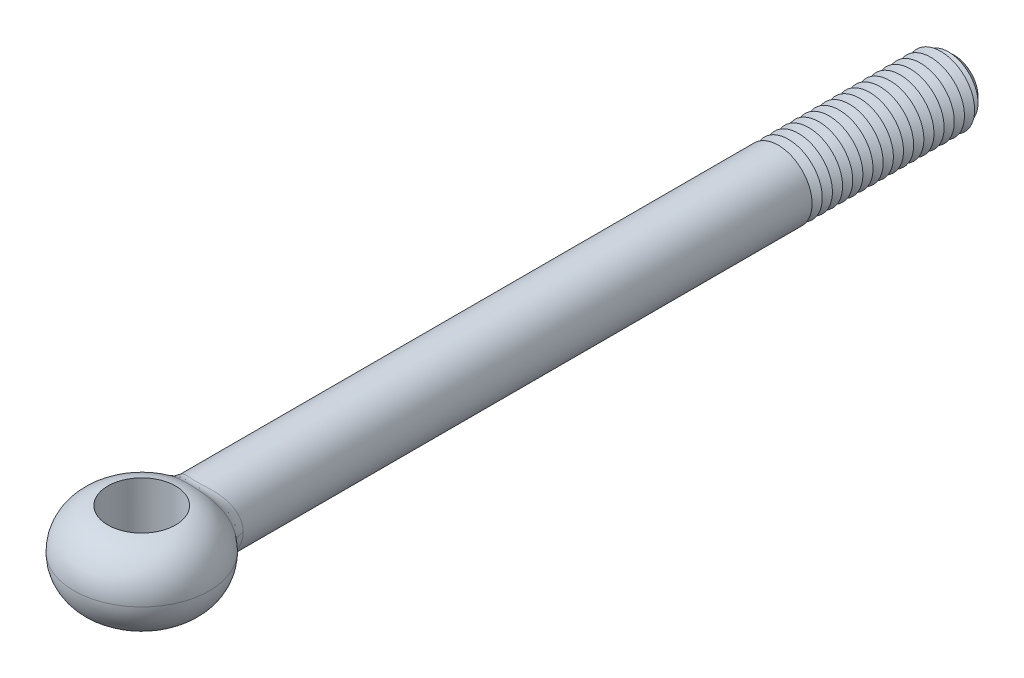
ISO-10303-21;
HEADER;
FILE_DESCRIPTION(('STEP AP214'),'2;1');
FILE_NAME('part.step','',(''),(''),'','','');
FILE_SCHEMA(('AUTOMOTIVE_DESIGN { 1 0 10303 214 1 1 1 1 }'));
ENDSEC;
DATA;
#1=APPLICATION_CONTEXT('core data for automotive mechanical design processes');
#2=APPLICATION_PROTOCOL_DEFINITION('international standard','automotive_design',2000,#1);
#3=PRODUCT_CONTEXT('',#1,'mechanical');
#4=PRODUCT('Part','Part','',(#3));
#5=PRODUCT_RELATED_PRODUCT_CATEGORY('part','',(#4));
#6=PRODUCT_DEFINITION_FORMATION('','',#4);
#7=PRODUCT_DEFINITION_CONTEXT('part definition',#1,'design');
#8=PRODUCT_DEFINITION('design','',#6,#7);
#9=PRODUCT_DEFINITION_SHAPE('','',#8);
#10=(LENGTH_UNIT() NAMED_UNIT(*) SI_UNIT(.MILLI.,.METRE.));
#11=(NAMED_UNIT(*) PLANE_ANGLE_UNIT() SI_UNIT($,.RADIAN.));
#12=(NAMED_UNIT(*) SI_UNIT($,.STERADIAN.) SOLID_ANGLE_UNIT());
#13=UNCERTAINTY_MEASURE_WITH_UNIT(LENGTH_MEASURE(1.E-05),#10,'distance_accuracy_value','');
#14=(GEOMETRIC_REPRESENTATION_CONTEXT(3) GLOBAL_UNCERTAINTY_ASSIGNED_CONTEXT((#13)) GLOBAL_UNIT_ASSIGNED_CONTEXT((#10,
#11,#12)) REPRESENTATION_CONTEXT('',''));
#15=CARTESIAN_POINT('',(0.,0.,0.));
#16=DIRECTION('',(0.,0.,1.));
#17=DIRECTION('',(1.,0.,0.));
#18=AXIS2_PLACEMENT_3D('',#15,#16,#17);
#19=CARTESIAN_POINT('',(0.,0.,-120.));
#20=DIRECTION('',(0.,0.,1.));
#21=DIRECTION('',(1.,0.,0.));
#22=AXIS2_PLACEMENT_3D('',#19,#20,#21);
#23=CYLINDRICAL_SURFACE('',#22,5.);
#24=CARTESIAN_POINT('',(0.,0.,-94.));
#25=DIRECTION('',(0.,0.,-1.));
#26=DIRECTION('',(-1.,0.,0.));
#27=AXIS2_PLACEMENT_3D('',#24,#25,#26);
#28=CIRCLE('',#27,5.);
#29=CARTESIAN_POINT('',(-5.,0.,-94.));
#30=VERTEX_POINT('',#29);
#31=EDGE_CURVE('E79',#30,#30,#28,.T.);
#32=ORIENTED_EDGE('',*,*,#31,.F.);
#33=EDGE_LOOP('',(#32));
#34=FACE_BOUND('',#33,.T.);
#35=CARTESIAN_POINT('',(5.70933633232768,-1.67793970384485,-7.91661551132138));
#36=CARTESIAN_POINT('',(4.78485907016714,-1.45712787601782,-8.66263274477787));
#37=CARTESIAN_POINT('',(4.74222098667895,-1.58472083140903,-9.86340741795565));
#38=CARTESIAN_POINT('',(5.75730171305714,-1.54348560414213,-7.93032827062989));
#39=CARTESIAN_POINT('',(4.82077417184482,-1.33824625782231,-8.67714724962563));
#40=CARTESIAN_POINT('',(4.78467318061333,-1.45773640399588,-9.88591758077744));
#41=CARTESIAN_POINT('',(5.79949566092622,-1.40701265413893,-7.94241329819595));
#42=CARTESIAN_POINT('',(4.85215615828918,-1.2184928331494,-8.68986188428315));
#43=CARTESIAN_POINT('',(4.82205710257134,-1.3288452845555,-9.90573407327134));
#44=CARTESIAN_POINT('',(5.87207824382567,-1.13100094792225,-7.96322651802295));
#45=CARTESIAN_POINT('',(4.90596898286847,-0.977373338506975,-8.71170047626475));
#46=CARTESIAN_POINT('',(4.8864097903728,-1.06816756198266,-9.93983844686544));
#47=CARTESIAN_POINT('',(5.90246657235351,-0.991462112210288,-7.97195462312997));
#48=CARTESIAN_POINT('',(4.92837078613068,-0.856067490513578,-8.72081272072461));
#49=CARTESIAN_POINT('',(4.91337828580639,-0.936380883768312,-9.95412618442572));
#50=CARTESIAN_POINT('',(5.95114734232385,-0.710445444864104,-7.9859445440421));
#51=CARTESIAN_POINT('',(4.96420368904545,-0.612503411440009,-8.73540084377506));
#52=CARTESIAN_POINT('',(4.95659653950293,-0.670976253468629,-9.9770185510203));
#53=CARTESIAN_POINT('',(5.96945246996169,-0.568969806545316,-7.99120999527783));
#54=CARTESIAN_POINT('',(4.97762446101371,-0.4903115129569,-8.7408725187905));
#55=CARTESIAN_POINT('',(4.97285753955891,-0.53736037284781,-9.98562914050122));
#56=CARTESIAN_POINT('',(5.99388312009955,-0.285021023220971,-7.99823914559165));
#57=CARTESIAN_POINT('',(4.99552781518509,-0.245401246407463,-8.74817451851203));
#58=CARTESIAN_POINT('',(4.9945634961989,-0.269186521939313,-9.99712197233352));
#59=CARTESIAN_POINT('',(6.00000915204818,-0.142547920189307,-8.00000299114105));
#60=CARTESIAN_POINT('',(5.00000073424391,-0.122751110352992,-8.75000090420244));
#61=CARTESIAN_POINT('',(5.00000890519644,-0.134628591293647,-10.0000044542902));
#62=CARTESIAN_POINT('',(5.99998170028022,0.285027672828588,-7.9999940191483));
#63=CARTESIAN_POINT('',(4.99999853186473,0.245443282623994,-8.74999819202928));
#64=CARTESIAN_POINT('',(4.99998219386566,0.269192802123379,-9.99999109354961));
#65=CARTESIAN_POINT('',(5.97543439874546,0.570354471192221,-7.99292407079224));
#66=CARTESIAN_POINT('',(4.9821186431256,0.490872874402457,-8.74269384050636));
#67=CARTESIAN_POINT('',(4.97815756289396,0.538668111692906,-9.98843996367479));
#68=CARTESIAN_POINT('',(5.87802487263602,1.13244543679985,-7.96493065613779));
#69=CARTESIAN_POINT('',(4.9104019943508,0.97806395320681,-8.71349780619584));
#70=CARTESIAN_POINT('',(4.89167997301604,1.06953180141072,-9.94263205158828));
#71=CARTESIAN_POINT('',(5.80517393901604,1.40921158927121,-7.94401042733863));
#72=CARTESIAN_POINT('',(4.85673202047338,1.2193014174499,-8.69167389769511));
#73=CARTESIAN_POINT('',(4.82703702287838,1.33092205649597,-9.90838057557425));
#74=CARTESIAN_POINT('',(5.61360560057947,1.94636814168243,-7.88925114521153));
#75=CARTESIAN_POINT('',(4.71337355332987,1.6936723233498,-8.63374813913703));
#76=CARTESIAN_POINT('',(4.65749953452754,1.83823657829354,-9.81848441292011));
#77=CARTESIAN_POINT('',(5.49493943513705,2.20677645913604,-7.85542652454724));
#78=CARTESIAN_POINT('',(4.62401912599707,1.92638432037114,-8.5977797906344));
#79=CARTESIAN_POINT('',(4.55264996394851,2.08417776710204,-9.76286362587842));
#80=CARTESIAN_POINT('',(5.21512465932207,2.70477762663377,-7.77634454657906));
#81=CARTESIAN_POINT('',(4.40944274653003,2.37905924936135,-8.51226210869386));
#82=CARTESIAN_POINT('',(4.30638809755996,2.55451220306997,-9.63232210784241));
#83=CARTESIAN_POINT('',(5.05396822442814,2.94236626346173,-7.73108508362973));
#84=CARTESIAN_POINT('',(4.28460020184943,2.59873536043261,-8.46285983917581));
#85=CARTESIAN_POINT('',(4.16496906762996,2.77890147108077,-9.55739782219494));
#86=CARTESIAN_POINT('',(4.68878033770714,3.39465162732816,-7.63009758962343));
#87=CARTESIAN_POINT('',(3.99636042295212,3.02506283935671,-8.35059743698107));
#88=CARTESIAN_POINT('',(3.84629057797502,3.20605987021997,-9.38937425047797));
#89=CARTESIAN_POINT('',(4.48379609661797,3.6086457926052,-7.5741404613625));
#90=CARTESIAN_POINT('',(3.83251261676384,3.23118784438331,-8.28758835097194));
#91=CARTESIAN_POINT('',(3.66823867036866,3.40816547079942,-9.29587502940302));
#92=CARTESIAN_POINT('',(4.03738444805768,4.00257302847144,-7.45571442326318));
#93=CARTESIAN_POINT('',(3.4692141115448,3.61860897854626,-8.151626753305));
#94=CARTESIAN_POINT('',(3.28354447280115,3.78020786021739,-9.0966982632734));
#95=CARTESIAN_POINT('',(3.79593554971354,4.18248587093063,-7.39324168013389));
#96=CARTESIAN_POINT('',(3.27014962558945,3.79997642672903,-8.07879276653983));
#97=CARTESIAN_POINT('',(3.07688532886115,3.95012554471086,-8.99101354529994));
#98=CARTESIAN_POINT('',(3.40123219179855,4.42911791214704,-7.29642098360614));
#99=CARTESIAN_POINT('',(2.93930728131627,4.05417647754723,-7.96363404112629));
#100=CARTESIAN_POINT('',(2.74263758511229,4.18305580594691,-8.82596610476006));
#101=CARTESIAN_POINT('',(3.25969837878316,4.50936136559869,-7.26261845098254));
#102=CARTESIAN_POINT('',(2.8201432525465,4.13782103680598,-7.92314276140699));
#103=CARTESIAN_POINT('',(2.62340068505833,4.25884128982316,-8.76811514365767));
#104=CARTESIAN_POINT('',(2.96753926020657,4.65896012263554,-7.19555640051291));
#105=CARTESIAN_POINT('',(2.57266117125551,4.2954808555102,-7.84210488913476));
#106=CARTESIAN_POINT('',(2.37882216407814,4.40012900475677,-8.65285466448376));
#107=CARTESIAN_POINT('',(2.81691254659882,4.728313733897,-7.16229696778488));
#108=CARTESIAN_POINT('',(2.44436296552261,4.36954883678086,-7.80155235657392));
#109=CARTESIAN_POINT('',(2.25347959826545,4.46562963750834,-8.59544521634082));
#110=CARTESIAN_POINT('',(2.5068398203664,4.85571433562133,-7.09757737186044));
#111=CARTESIAN_POINT('',(2.1789642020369,4.50703843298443,-7.72199796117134));
#112=CARTESIAN_POINT('',(1.99726881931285,4.58595242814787,-8.48324311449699));
#113=CARTESIAN_POINT('',(2.34739348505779,4.91376091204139,-7.06611727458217));
#114=CARTESIAN_POINT('',(2.04185963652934,4.57052436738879,-7.68297774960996));
#115=CARTESIAN_POINT('',(1.86640040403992,4.64077419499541,-8.42845055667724));
#116=CARTESIAN_POINT('',(2.01991855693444,5.01813022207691,-7.00658441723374));
#117=CARTESIAN_POINT('',(1.7592739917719,4.68575118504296,-7.60861634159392));
#118=CARTESIAN_POINT('',(1.59962901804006,4.73934521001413,-8.32432471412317));
#119=CARTESIAN_POINT('',(1.85189250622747,5.0644564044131,-6.97851066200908));
#120=CARTESIAN_POINT('',(1.61375899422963,4.73756667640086,-7.57324263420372));
#121=CARTESIAN_POINT('',(1.46372754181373,4.78309771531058,-8.27498982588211));
#122=CARTESIAN_POINT('',(1.54958918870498,5.13512197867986,-6.93385736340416));
#123=CARTESIAN_POINT('',(1.35128568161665,4.81724563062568,-7.51664891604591));
#124=CARTESIAN_POINT('',(1.22100149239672,4.84983742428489,-8.19622805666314));
#125=CARTESIAN_POINT('',(1.41702320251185,5.16206874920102,-6.91614202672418));
#126=CARTESIAN_POINT('',(1.23600744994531,4.84788364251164,-7.49407261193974));
#127=CARTESIAN_POINT('',(1.11512872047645,4.87528715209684,-8.16487589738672));
#128=CARTESIAN_POINT('',(1.1478154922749,5.20870116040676,-6.88469379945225));
#129=CARTESIAN_POINT('',(1.00167278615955,4.9011561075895,-7.4538678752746));
#130=CARTESIAN_POINT('',(0.901179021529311,4.91932887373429,-8.10909028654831));
#131=CARTESIAN_POINT('',(1.01117500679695,5.22838898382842,-6.87095971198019));
#132=CARTESIAN_POINT('',(0.882566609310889,4.92382141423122,-7.43621856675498));
#133=CARTESIAN_POINT('',(0.793102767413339,4.93792292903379,-8.08465475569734));
#134=CARTESIAN_POINT('',(0.735138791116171,5.26020100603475,-6.84839392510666));
#135=CARTESIAN_POINT('',(0.641846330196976,4.96055155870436,-7.40716717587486));
#136=CARTESIAN_POINT('',(0.575594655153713,4.96796761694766,-8.04444298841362));
#137=CARTESIAN_POINT('',(0.595753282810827,5.27234921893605,-6.83954667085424));
#138=CARTESIAN_POINT('',(0.520175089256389,4.97466593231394,-7.39572843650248));
#139=CARTESIAN_POINT('',(0.46616824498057,4.97944092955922,-8.02863927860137));
#140=CARTESIAN_POINT('',(0.315165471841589,5.28897400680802,-6.82736189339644));
#141=CARTESIAN_POINT('',(0.275245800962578,4.99399490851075,-7.37997063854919));
#142=CARTESIAN_POINT('',(0.246357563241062,4.99514211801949,-8.00686062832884));
#143=CARTESIAN_POINT('',(0.173963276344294,5.2934510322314,-6.82402404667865));
#144=CARTESIAN_POINT('',(0.151908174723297,4.99922289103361,-7.37564077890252));
#145=CARTESIAN_POINT('',(0.135973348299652,4.99937041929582,-8.0008851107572));
#146=CARTESIAN_POINT('',(-0.108989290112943,5.29464772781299,-6.82313610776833));
#147=CARTESIAN_POINT('',(-0.0951661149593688,5.00061790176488,-7.37449052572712));
#148=CARTESIAN_POINT('',(-0.0851888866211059,5.00050063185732,-7.99929621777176));
#149=CARTESIAN_POINT('',(-0.250740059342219,5.29134475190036,-6.82560291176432));
#150=CARTESIAN_POINT('',(-0.218988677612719,4.99675944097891,-7.37769125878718));
#151=CARTESIAN_POINT('',(-0.195967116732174,4.99738115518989,-8.00371309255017));
#152=CARTESIAN_POINT('',(-0.532654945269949,5.27700059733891,-6.83615005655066));
#153=CARTESIAN_POINT('',(-0.465097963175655,4.98007057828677,-7.39133726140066));
#154=CARTESIAN_POINT('',(-0.416687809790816,4.98383389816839,-8.02257034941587));
#155=CARTESIAN_POINT('',(-0.67281897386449,5.26595899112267,-6.84423070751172));
#156=CARTESIAN_POINT('',(-0.587466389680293,4.96722840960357,-7.40179208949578));
#157=CARTESIAN_POINT('',(-0.526630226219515,4.97340571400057,-8.03701128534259));
#158=CARTESIAN_POINT('',(-0.950555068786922,5.23628582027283,-6.86540697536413));
#159=CARTESIAN_POINT('',(-0.829715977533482,4.93292383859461,-7.42907738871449));
#160=CARTESIAN_POINT('',(-0.745246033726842,4.94538105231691,-8.07476785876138));
#161=CARTESIAN_POINT('',(-1.08811773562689,5.21763079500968,-6.87851808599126));
#162=CARTESIAN_POINT('',(-0.949657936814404,4.91141341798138,-7.44594394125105));
#163=CARTESIAN_POINT('',(-0.853914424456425,4.92776241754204,-8.09811091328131));
#164=CARTESIAN_POINT('',(-1.35925236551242,5.17298457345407,-6.90887821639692));
#165=CARTESIAN_POINT('',(-1.18574740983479,4.86032128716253,-7.48480231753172));
#166=CARTESIAN_POINT('',(-1.06910038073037,4.88559654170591,-8.15200622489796));
#167=CARTESIAN_POINT('',(-1.49282310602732,5.14699115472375,-6.92612848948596));
#168=CARTESIAN_POINT('',(-1.3019475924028,4.83070907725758,-7.50681516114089));
#169=CARTESIAN_POINT('',(-1.17561728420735,4.86104720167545,-8.18256066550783));
#170=CARTESIAN_POINT('',(-1.79412725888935,5.07920893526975,-6.96939072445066));
#171=CARTESIAN_POINT('',(-1.56367143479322,4.75412691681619,-7.56172008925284));
#172=CARTESIAN_POINT('',(-1.41717349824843,4.79703066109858,-8.25893420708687));
#173=CARTESIAN_POINT('',(-1.96031219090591,5.03502254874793,-6.9964861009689));
#174=CARTESIAN_POINT('',(-1.7076868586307,4.70458666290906,-7.59591788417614));
#175=CARTESIAN_POINT('',(-1.55135538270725,4.75529907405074,-8.30659722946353));
#176=CARTESIAN_POINT('',(-2.28442640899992,4.93526422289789,-7.05416576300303));
#177=CARTESIAN_POINT('',(-1.98760872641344,4.59415189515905,-7.66809997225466));
#178=CARTESIAN_POINT('',(-1.81491123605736,4.66108287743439,-8.4075911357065));
#179=CARTESIAN_POINT('',(-2.44235350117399,4.87968927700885,-7.08475096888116));
#180=CARTESIAN_POINT('',(-2.12355225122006,4.53318622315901,-7.7061166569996));
#181=CARTESIAN_POINT('',(-1.94428392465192,4.6085954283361,-8.46092351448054));
#182=CARTESIAN_POINT('',(-2.74972999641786,4.75754570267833,-7.14786353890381));
#183=CARTESIAN_POINT('',(-2.38698376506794,4.4009346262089,-7.78387796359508));
#184=CARTESIAN_POINT('',(-2.19777297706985,4.49323760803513,-8.57047607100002));
#185=CARTESIAN_POINT('',(-2.89917785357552,4.69097507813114,-7.18039125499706));
#186=CARTESIAN_POINT('',(-2.51447749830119,4.3295842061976,-7.82364214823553));
#187=CARTESIAN_POINT('',(-2.32188838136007,4.43036535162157,-8.62669677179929));
#188=CARTESIAN_POINT('',(-3.18935059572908,4.54721522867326,-7.24614756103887));
#189=CARTESIAN_POINT('',(-2.76071126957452,4.17750789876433,-7.90331839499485));
#190=CARTESIAN_POINT('',(-2.56432860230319,4.29459216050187,-8.73986385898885));
#191=CARTESIAN_POINT('',(-3.33007632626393,4.470027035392,-7.27937608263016));
#192=CARTESIAN_POINT('',(-2.87943530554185,4.09672952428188,-7.94323785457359));
#193=CARTESIAN_POINT('',(-2.68265398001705,4.22169220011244,-8.79681017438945));
#194=CARTESIAN_POINT('',(-3.6042467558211,4.30435953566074,-7.34597396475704));
#195=CARTESIAN_POINT('',(-3.10933500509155,3.92558371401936,-8.02254739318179));
#196=CARTESIAN_POINT('',(-2.91439424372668,4.06522845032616,-8.91049638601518));
#197=CARTESIAN_POINT('',(-3.73757981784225,4.21575233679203,-7.37933998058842));
#198=CARTESIAN_POINT('',(-3.2203567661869,3.83507165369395,-8.06191973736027));
#199=CARTESIAN_POINT('',(-3.02773025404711,3.98154387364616,-8.96722500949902));
#200=CARTESIAN_POINT('',(-3.99465713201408,4.02844559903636,-7.44499615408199));
#201=CARTESIAN_POINT('',(-3.4329684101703,3.6461579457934,-8.13872764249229));
#202=CARTESIAN_POINT('',(-3.24724328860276,3.80464306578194,-9.07845523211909));
#203=CARTESIAN_POINT('',(-4.11839810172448,3.92974263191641,-7.47728594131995));
#204=CARTESIAN_POINT('',(-3.53450475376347,3.54772458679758,-8.17615102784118));
#205=CARTESIAN_POINT('',(-3.35341786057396,3.7114235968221,-9.13295606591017));
#206=CARTESIAN_POINT('',(-4.4742983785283,3.61934152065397,-7.57148302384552));
#207=CARTESIAN_POINT('',(-3.82504690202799,3.24133753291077,-8.28463882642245));
#208=CARTESIAN_POINT('',(-3.65994988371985,3.41826699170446,-9.29144497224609));
#209=CARTESIAN_POINT('',(-4.69150601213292,3.39312616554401,-7.63081129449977));
#210=CARTESIAN_POINT('',(-3.99866350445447,3.02332690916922,-8.35144779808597));
#211=CARTESIAN_POINT('',(-3.84863084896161,3.20461915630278,-9.39057819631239));
#212=CARTESIAN_POINT('',(-5.08239605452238,2.90516999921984,-7.7389888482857));
#213=CARTESIAN_POINT('',(-4.30703736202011,2.56373758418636,-8.47164826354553));
#214=CARTESIAN_POINT('',(-4.18981749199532,2.7437716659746,-9.57053028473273));
#215=CARTESIAN_POINT('',(-5.25565953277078,2.6431214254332,-7.78773667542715));
#216=CARTESIAN_POINT('',(-4.44086470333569,2.32212555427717,-8.52470741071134));
#217=CARTESIAN_POINT('',(-4.34197429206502,2.49628134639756,-9.6511722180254));
#218=CARTESIAN_POINT('',(-5.47691244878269,2.23061013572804,-7.85038077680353));
#219=CARTESIAN_POINT('',(-4.60972026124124,1.94915142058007,-8.5921412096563));
#220=CARTESIAN_POINT('',(-4.53685371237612,2.10668735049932,-9.75449897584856));
#221=CARTESIAN_POINT('',(-5.54423274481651,2.08983618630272,-7.86951868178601));
#222=CARTESIAN_POINT('',(-4.66073830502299,1.82281743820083,-8.61261317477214));
#223=CARTESIAN_POINT('',(-4.59626286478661,1.97373417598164,-9.78600646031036));
#224=CARTESIAN_POINT('',(-5.6655118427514,1.80280855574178,-7.90408060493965));
#225=CARTESIAN_POINT('',(-4.75217227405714,1.56712957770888,-8.64941478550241));
#226=CARTESIAN_POINT('',(-4.70342427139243,1.70265252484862,-9.84283573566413));
#227=CARTESIAN_POINT('',(-5.71947280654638,1.65655576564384,-7.91950522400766));
#228=CARTESIAN_POINT('',(-4.79253620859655,1.43783844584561,-8.66572382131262));
#229=CARTESIAN_POINT('',(-4.75117841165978,1.56452488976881,-9.86815852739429));
#230=CARTESIAN_POINT('',(-5.84364491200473,1.26465047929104,-7.95505164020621));
#231=CARTESIAN_POINT('',(-4.88513469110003,1.09319520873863,-8.7032138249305));
#232=CARTESIAN_POINT('',(-4.86116183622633,1.19439211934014,-9.92646411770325));
#233=CARTESIAN_POINT('',(-5.90216979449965,1.0152606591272,-7.97186627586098));
#234=CARTESIAN_POINT('',(-4.9281911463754,0.87634254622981,-8.72073502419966));
#235=CARTESIAN_POINT('',(-4.91310928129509,0.958857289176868,-9.95398462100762));
#236=CARTESIAN_POINT('',(-5.98033817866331,0.510520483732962,-7.99433762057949));
#237=CARTESIAN_POINT('',(-4.98567189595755,0.439420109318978,-8.74414731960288));
#238=CARTESIAN_POINT('',(-4.98251976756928,0.482158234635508,-9.99074818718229));
#239=CARTESIAN_POINT('',(-5.99999017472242,0.255171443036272,-7.99999676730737));
#240=CARTESIAN_POINT('',(-5.00000016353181,0.219732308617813,-8.74999935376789));
#241=CARTESIAN_POINT('',(-4.99999034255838,0.240995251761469,-9.99999524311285));
#242=CARTESIAN_POINT('',(-6.00000548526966,-0.142457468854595,-8.00000180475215));
#243=CARTESIAN_POINT('',(-4.99999990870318,-0.12267252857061,-8.75000036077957));
#244=CARTESIAN_POINT('',(-5.00000539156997,-0.134543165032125,-10.0000026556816));
#245=CARTESIAN_POINT('',(-5.99388893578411,-0.284859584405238,-7.99824078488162));
#246=CARTESIAN_POINT('',(-4.99553255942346,-0.245262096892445,-8.74817640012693));
#247=CARTESIAN_POINT('',(-4.9945685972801,-0.269034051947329,-9.99712468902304));
#248=CARTESIAN_POINT('',(-5.96948629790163,-0.568670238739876,-7.99121976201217));
#249=CARTESIAN_POINT('',(-4.97764876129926,-0.490053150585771,-8.74088248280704));
#250=CARTESIAN_POINT('',(-4.97288766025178,-0.537077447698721,-9.98564507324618));
#251=CARTESIAN_POINT('',(-5.95119862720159,-0.71007864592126,-7.98595930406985));
#252=CARTESIAN_POINT('',(-4.96424116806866,-0.612186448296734,-8.73541613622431));
#253=CARTESIAN_POINT('',(-4.9566421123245,-0.670629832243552,-9.97704267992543));
#254=CARTESIAN_POINT('',(-5.90253985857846,-0.991109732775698,-7.9719756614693));
#255=CARTESIAN_POINT('',(-4.92842498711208,-0.855761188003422,-8.72083475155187));
#256=CARTESIAN_POINT('',(-4.9134433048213,-0.936048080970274,-9.95416063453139));
#257=CARTESIAN_POINT('',(-5.87214378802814,-1.13072810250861,-7.96324532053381));
#258=CARTESIAN_POINT('',(-4.90601756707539,-0.977135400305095,-8.71172020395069));
#259=CARTESIAN_POINT('',(-4.88646791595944,-1.06790987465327,-9.93986924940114));
#260=CARTESIAN_POINT('',(-5.79953551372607,-1.40688471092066,-7.94242472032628));
#261=CARTESIAN_POINT('',(-4.85218573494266,-1.21838046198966,-8.68987387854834));
#262=CARTESIAN_POINT('',(-4.82209242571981,-1.32872444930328,-9.90575279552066));
#263=CARTESIAN_POINT('',(-5.75732457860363,-1.54342327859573,-7.9303348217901));
#264=CARTESIAN_POINT('',(-4.82079113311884,-1.33819110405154,-8.67715412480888));
#265=CARTESIAN_POINT('',(-4.78469344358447,-1.45767754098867,-9.8859283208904));
#266=CARTESIAN_POINT('',(-5.70933633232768,-1.67793970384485,-7.91661551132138));
#267=CARTESIAN_POINT('',(-4.78485907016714,-1.45712787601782,-8.66263274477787));
#268=CARTESIAN_POINT('',(-4.74222098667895,-1.58472083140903,-9.86340741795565));
#269=(BOUNDED_SURFACE() B_SPLINE_SURFACE(3,2,((#35,#36,#37),(#38,#39,#40),(#41,#42,#43),(#44,
#45,#46),(#47,#48,#49),(#50,#51,#52),(#53,#54,#55),(#56,#57,#58),(#59,#60,#61),(#62,#63,#64),
(#65,#66,#67),(#68,#69,#70),(#71,#72,#73),(#74,#75,#76),(#77,#78,#79),(#80,#81,#82),(#83,#84,
#85),(#86,#87,#88),(#89,#90,#91),(#92,#93,#94),(#95,#96,#97),(#98,#99,#100),(#101,#102,#103),
(#104,#105,#106),(#107,#108,#109),(#110,#111,#112),(#113,#114,#115),(#116,#117,#118),(#119,#120,
#121),(#122,#123,#124),(#125,#126,#127),(#128,#129,#130),(#131,#132,#133),(#134,#135,#136),
(#137,#138,#139),(#140,#141,#142),(#143,#144,#145),(#146,#147,#148),(#149,#150,#151),(#152,#153,
#154),(#155,#156,#157),(#158,#159,#160),(#161,#162,#163),(#164,#165,#166),(#167,#168,#169),
(#170,#171,#172),(#173,#174,#175),(#176,#177,#178),(#179,#180,#181),(#182,#183,#184),(#185,#186,
#187),(#188,#189,#190),(#191,#192,#193),(#194,#195,#196),(#197,#198,#199),(#200,#201,#202),
(#203,#204,#205),(#206,#207,#208),(#209,#210,#211),(#212,#213,#214),(#215,#216,#217),(#218,#219,
#220),(#221,#222,#223),(#224,#225,#226),(#227,#228,#229),(#230,#231,#232),(#233,#234,#235),
(#236,#237,#238),(#239,#240,#241),(#242,#243,#244),(#245,#246,#247),(#248,#249,#250),(#251,#252,
#253),(#254,#255,#256),(#257,#258,#259),(#260,#261,#262),(#263,#264,#265),(#266,#267,#268)),
.UNSPECIFIED.,.F.,.F.,.F.) B_SPLINE_SURFACE_WITH_KNOTS((4,2,2,2,2,2,2,2,2,2,2,2,2,2,2,2,2,2,2,2,
2,2,2,2,2,2,2,2,2,2,2,2,2,2,2,2,2,2,4),(3,3),(0.,0.606107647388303,1.21223102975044,
1.81771702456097,2.42317769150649,3.63380948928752,4.8441584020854,6.05315757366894,
7.26237953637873,8.50119582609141,9.74074509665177,10.3991744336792,11.0577059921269,
11.7162616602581,12.3746233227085,12.8731342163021,13.3714950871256,13.8682603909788,
14.3649965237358,14.8631803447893,15.3613916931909,15.8611500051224,16.3610598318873,
17.0084707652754,17.6560528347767,18.3037525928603,18.9513894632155,19.607039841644,
20.2629136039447,21.5729073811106,22.8949562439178,23.5562483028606,24.2174332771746,
25.3015758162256,26.385481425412,26.9906057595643,27.5958087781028,28.2022664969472,
28.8086591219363),(0.,1.),
.UNSPECIFIED.) GEOMETRIC_REPRESENTATION_ITEM() RATIONAL_B_SPLINE_SURFACE(((1.,0.90035547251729,
1.),(1.,0.899388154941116,1.),(1.,0.898532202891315,1.),(1.,0.897054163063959,1.),(1.,
0.896432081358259,1.),(1.,0.895433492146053,1.),(1.,0.895056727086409,1.),(1.,0.894553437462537,
1.),(1.,0.894426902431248,1.),(1.,0.894427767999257,1.),(1.,0.89493539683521,1.),(1.,
0.896933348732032,1.),(1.,0.898423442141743,1.),(1.,0.902285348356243,1.),(1.,0.904656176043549,
1.),(1.,0.910127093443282,1.),(1.,0.913227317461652,1.),(1.,0.9200380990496,1.),(1.,
0.923761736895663,1.),(1.,0.931504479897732,1.),(1.,0.935523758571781,1.),(1.,0.941644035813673,
1.),(1.,0.943760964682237,1.),(1.,0.947923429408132,1.),(1.,0.949968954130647,1.),(1.,
0.953916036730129,1.),(1.,0.955817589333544,1.),(1.,0.959389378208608,1.),(1.,0.96105968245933,
1.),(1.,0.963700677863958,1.),(1.,0.964742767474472,1.),(1.,0.966586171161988,1.),(1.,
0.967387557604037,1.),(1.,0.968701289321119,1.),(1.,0.969214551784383,1.),(1.,0.96992083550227,
1.),(1.,0.970113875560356,1.),(1.,0.97016526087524,1.),(1.,0.970022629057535,1.),(1.,
0.96941153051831,1.),(1.,0.968943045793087,1.),(1.,0.967711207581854,1.),(1.,0.966946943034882,
1.),(1.,0.965169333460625,1.),(1.,0.964155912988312,1.),(1.,0.961600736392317,1.),(1.,
0.959991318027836,1.),(1.,0.956537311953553,1.),(1.,0.954692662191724,1.),(1.,0.950852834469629,
1.),(1.,0.948857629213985,1.),(1.,0.944787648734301,1.),(1.,0.942712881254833,1.),(1.,
0.938516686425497,1.),(1.,0.936394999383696,1.),(1.,0.932182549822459,1.),(1.,0.930091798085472,
1.),(1.,0.923939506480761,1.),(1.,0.91999203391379,1.),(1.,0.912692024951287,1.),(1.,
0.909345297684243,1.),(1.,0.905000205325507,1.),(1.,0.903664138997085,1.),(1.,0.901240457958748,
1.),(1.,0.900152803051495,1.),(1.,0.897638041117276,1.),(1.,0.896438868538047,1.),(1.,
0.894833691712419,1.),(1.,0.894427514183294,1.),(1.,0.894427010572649,1.),(1.,0.894553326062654,
1.),(1.,0.895056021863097,1.),(1.,0.895432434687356,1.),(1.,0.896430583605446,1.),(1.,
0.897052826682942,1.),(1.,0.898531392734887,1.),(1.,0.89938769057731,1.),(1.,0.90035547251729,1.))) REPRESENTATION_ITEM('') SURFACE());
#270=CARTESIAN_POINT('',(-4.74222098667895,-1.58472083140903,-9.86340741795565));
#271=CARTESIAN_POINT('',(-4.78469344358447,-1.45767754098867,-9.8859283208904));
#272=CARTESIAN_POINT('',(-4.82209242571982,-1.32872444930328,-9.90575279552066));
#273=CARTESIAN_POINT('',(-4.88646791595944,-1.06790987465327,-9.93986924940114));
#274=CARTESIAN_POINT('',(-4.9134433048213,-0.936048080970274,-9.95416063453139));
#275=CARTESIAN_POINT('',(-4.9566421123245,-0.670629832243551,-9.97704267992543));
#276=CARTESIAN_POINT('',(-4.97288766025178,-0.537077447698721,-9.98564507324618));
#277=CARTESIAN_POINT('',(-4.9945685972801,-0.269034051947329,-9.99712468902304));
#278=CARTESIAN_POINT('',(-5.00000539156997,-0.134543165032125,-10.0000026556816));
#279=CARTESIAN_POINT('',(-4.99999034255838,0.240995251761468,-9.99999524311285));
#280=CARTESIAN_POINT('',(-4.98251976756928,0.482158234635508,-9.99074818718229));
#281=CARTESIAN_POINT('',(-4.91310928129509,0.958857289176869,-9.95398462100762));
#282=CARTESIAN_POINT('',(-4.86116183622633,1.19439211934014,-9.92646411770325));
#283=CARTESIAN_POINT('',(-4.75117841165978,1.56452488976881,-9.86815852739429));
#284=CARTESIAN_POINT('',(-4.70342427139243,1.70265252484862,-9.84283573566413));
#285=CARTESIAN_POINT('',(-4.59626286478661,1.97373417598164,-9.78600646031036));
#286=CARTESIAN_POINT('',(-4.53685371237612,2.10668735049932,-9.75449897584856));
#287=CARTESIAN_POINT('',(-4.34197429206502,2.49628134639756,-9.6511722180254));
#288=CARTESIAN_POINT('',(-4.18981749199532,2.7437716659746,-9.57053028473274));
#289=CARTESIAN_POINT('',(-3.84863084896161,3.20461915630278,-9.39057819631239));
#290=CARTESIAN_POINT('',(-3.65994988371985,3.41826699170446,-9.29144497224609));
#291=CARTESIAN_POINT('',(-3.35341786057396,3.7114235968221,-9.13295606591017));
#292=CARTESIAN_POINT('',(-3.24724328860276,3.80464306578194,-9.07845523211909));
#293=CARTESIAN_POINT('',(-3.02773025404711,3.98154387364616,-8.96722500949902));
#294=CARTESIAN_POINT('',(-2.91439424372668,4.06522845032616,-8.91049638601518));
#295=CARTESIAN_POINT('',(-2.68265398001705,4.22169220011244,-8.79681017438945));
#296=CARTESIAN_POINT('',(-2.56432860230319,4.29459216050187,-8.73986385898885));
#297=CARTESIAN_POINT('',(-2.32188838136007,4.43036535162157,-8.62669677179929));
#298=CARTESIAN_POINT('',(-2.19777297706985,4.49323760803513,-8.57047607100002));
#299=CARTESIAN_POINT('',(-1.94428392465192,4.6085954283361,-8.46092351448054));
#300=CARTESIAN_POINT('',(-1.81491123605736,4.66108287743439,-8.4075911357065));
#301=CARTESIAN_POINT('',(-1.55135538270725,4.75529907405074,-8.30659722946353));
#302=CARTESIAN_POINT('',(-1.41717349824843,4.79703066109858,-8.25893420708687));
#303=CARTESIAN_POINT('',(-1.17561728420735,4.86104720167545,-8.18256066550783));
#304=CARTESIAN_POINT('',(-1.06910038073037,4.88559654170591,-8.15200622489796));
#305=CARTESIAN_POINT('',(-0.853914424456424,4.92776241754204,-8.09811091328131));
#306=CARTESIAN_POINT('',(-0.745246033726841,4.94538105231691,-8.07476785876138));
#307=CARTESIAN_POINT('',(-0.526630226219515,4.97340571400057,-8.03701128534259));
#308=CARTESIAN_POINT('',(-0.416687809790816,4.98383389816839,-8.02257034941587));
#309=CARTESIAN_POINT('',(-0.195967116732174,4.99738115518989,-8.00371309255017));
#310=CARTESIAN_POINT('',(-0.0851888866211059,5.00050063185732,-7.99929621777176));
#311=CARTESIAN_POINT('',(0.135973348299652,4.99937041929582,-8.0008851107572));
#312=CARTESIAN_POINT('',(0.246357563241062,4.99514211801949,-8.00686062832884));
#313=CARTESIAN_POINT('',(0.46616824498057,4.97944092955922,-8.02863927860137));
#314=CARTESIAN_POINT('',(0.575594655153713,4.96796761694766,-8.04444298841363));
#315=CARTESIAN_POINT('',(0.793102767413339,4.93792292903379,-8.08465475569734));
#316=CARTESIAN_POINT('',(0.901179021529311,4.91932887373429,-8.10909028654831));
#317=CARTESIAN_POINT('',(1.11512872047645,4.87528715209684,-8.16487589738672));
#318=CARTESIAN_POINT('',(1.22100149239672,4.84983742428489,-8.19622805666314));
#319=CARTESIAN_POINT('',(1.46372754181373,4.78309771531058,-8.27498982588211));
#320=CARTESIAN_POINT('',(1.59962901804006,4.73934521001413,-8.32432471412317));
#321=CARTESIAN_POINT('',(1.86640040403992,4.64077419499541,-8.42845055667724));
#322=CARTESIAN_POINT('',(1.99726881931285,4.58595242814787,-8.48324311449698));
#323=CARTESIAN_POINT('',(2.25347959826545,4.46562963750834,-8.59544521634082));
#324=CARTESIAN_POINT('',(2.37882216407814,4.40012900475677,-8.65285466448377));
#325=CARTESIAN_POINT('',(2.62340068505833,4.25884128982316,-8.76811514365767));
#326=CARTESIAN_POINT('',(2.74263758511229,4.18305580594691,-8.82596610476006));
#327=CARTESIAN_POINT('',(3.07688532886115,3.95012554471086,-8.99101354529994));
#328=CARTESIAN_POINT('',(3.28354447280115,3.78020786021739,-9.0966982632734));
#329=CARTESIAN_POINT('',(3.66823867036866,3.40816547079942,-9.29587502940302));
#330=CARTESIAN_POINT('',(3.84629057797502,3.20605987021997,-9.38937425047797));
#331=CARTESIAN_POINT('',(4.16496906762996,2.77890147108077,-9.55739782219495));
#332=CARTESIAN_POINT('',(4.30638809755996,2.55451220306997,-9.63232210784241));
#333=CARTESIAN_POINT('',(4.55264996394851,2.08417776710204,-9.76286362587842));
#334=CARTESIAN_POINT('',(4.65749953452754,1.83823657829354,-9.81848441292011));
#335=CARTESIAN_POINT('',(4.82703702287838,1.33092205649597,-9.90838057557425));
#336=CARTESIAN_POINT('',(4.89167997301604,1.06953180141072,-9.94263205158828));
#337=CARTESIAN_POINT('',(4.97815756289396,0.538668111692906,-9.98843996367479));
#338=CARTESIAN_POINT('',(4.99998219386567,0.269192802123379,-9.99999109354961));
#339=CARTESIAN_POINT('',(5.00000890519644,-0.134628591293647,-10.0000044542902));
#340=CARTESIAN_POINT('',(4.99456349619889,-0.269186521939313,-9.99712197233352));
#341=CARTESIAN_POINT('',(4.97285753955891,-0.53736037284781,-9.98562914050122));
#342=CARTESIAN_POINT('',(4.95659653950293,-0.670976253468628,-9.9770185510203));
#343=CARTESIAN_POINT('',(4.91337828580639,-0.936380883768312,-9.95412618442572));
#344=CARTESIAN_POINT('',(4.8864097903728,-1.06816756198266,-9.93983844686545));
#345=CARTESIAN_POINT('',(4.82205710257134,-1.3288452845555,-9.90573407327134));
#346=CARTESIAN_POINT('',(4.78467318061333,-1.45773640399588,-9.88591758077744));
#347=CARTESIAN_POINT('',(4.74222098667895,-1.58472083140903,-9.86340741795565));
#348=B_SPLINE_CURVE_WITH_KNOTS('',3,(#270,#271,#272,#273,#274,#275,#276,#277,#278,#279,#280,
#281,#282,#283,#284,#285,#286,#287,#288,#289,#290,#291,#292,#293,#294,#295,#296,#297,#298,#299,
#300,#301,#302,#303,#304,#305,#306,#307,#308,#309,#310,#311,#312,#313,#314,#315,#316,#317,#318,
#319,#320,#321,#322,#323,#324,#325,#326,#327,#328,#329,#330,#331,#332,#333,#334,#335,#336,#337,
#338,#339,#340,#341,#342,#343,#344,#345,#346,#347),.UNSPECIFIED.,.F.,.F.,(4,2,2,2,2,2,2,2,2,2,2,
2,2,2,2,2,2,2,2,2,2,2,2,2,2,2,2,2,2,2,2,2,2,2,2,2,2,2,4),(0.,0.606392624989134,1.21285034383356,
1.81805336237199,2.42317769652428,3.50708330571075,4.59122584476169,5.25241081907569,
5.91370287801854,7.2357517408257,8.54574551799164,9.20161928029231,9.85726965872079,
10.504906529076,11.1526062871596,11.800188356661,12.447599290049,12.9475091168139,
13.4472674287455,13.945478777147,14.4436625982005,14.9403987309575,15.4371640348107,
15.9355249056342,16.4340357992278,17.0923974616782,17.7509531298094,18.4094846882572,
19.0679140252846,20.3074632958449,21.5462795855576,22.7555015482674,23.9645007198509,
25.1748496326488,26.3854814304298,26.9909420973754,27.5964280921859,28.202551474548,
28.8086591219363),.UNSPECIFIED.);
#349=CARTESIAN_POINT('',(-5.,0.,-10.));
#350=VERTEX_POINT('',#349);
#351=CARTESIAN_POINT('',(5.,0.,-10.));
#352=VERTEX_POINT('',#351);
#353=EDGE_CURVE('E81',#350,#352,#348,.T.);
#354=ORIENTED_EDGE('',*,*,#353,.T.);
#355=CARTESIAN_POINT('',(-5.70933633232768,1.67793970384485,-7.91661551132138));
#356=CARTESIAN_POINT('',(-4.78485907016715,1.45712787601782,-8.66263274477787));
#357=CARTESIAN_POINT('',(-4.74222098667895,1.58472083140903,-9.86340741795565));
#358=CARTESIAN_POINT('',(-5.75730171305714,1.54348560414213,-7.93032827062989));
#359=CARTESIAN_POINT('',(-4.82077417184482,1.33824625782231,-8.67714724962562));
#360=CARTESIAN_POINT('',(-4.78467318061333,1.45773640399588,-9.88591758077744));
#361=CARTESIAN_POINT('',(-5.79949566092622,1.40701265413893,-7.94241329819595));
#362=CARTESIAN_POINT('',(-4.85215615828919,1.2184928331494,-8.68986188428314));
#363=CARTESIAN_POINT('',(-4.82205710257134,1.3288452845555,-9.90573407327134));
#364=CARTESIAN_POINT('',(-5.87207824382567,1.13100094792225,-7.96322651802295));
#365=CARTESIAN_POINT('',(-4.90596898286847,0.977373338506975,-8.71170047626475));
#366=CARTESIAN_POINT('',(-4.8864097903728,1.06816756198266,-9.93983844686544));
#367=CARTESIAN_POINT('',(-5.90246657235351,0.991462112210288,-7.97195462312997));
#368=CARTESIAN_POINT('',(-4.92837078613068,0.856067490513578,-8.72081272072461));
#369=CARTESIAN_POINT('',(-4.91337828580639,0.936380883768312,-9.95412618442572));
#370=CARTESIAN_POINT('',(-5.95114734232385,0.710445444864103,-7.9859445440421));
#371=CARTESIAN_POINT('',(-4.96420368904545,0.612503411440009,-8.73540084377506));
#372=CARTESIAN_POINT('',(-4.95659653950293,0.670976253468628,-9.9770185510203));
#373=CARTESIAN_POINT('',(-5.96945246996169,0.568969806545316,-7.99120999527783));
#374=CARTESIAN_POINT('',(-4.97762446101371,0.4903115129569,-8.7408725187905));
#375=CARTESIAN_POINT('',(-4.97285753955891,0.53736037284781,-9.98562914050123));
#376=CARTESIAN_POINT('',(-5.99388312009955,0.28502102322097,-7.99823914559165));
#377=CARTESIAN_POINT('',(-4.99552781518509,0.245401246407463,-8.74817451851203));
#378=CARTESIAN_POINT('',(-4.9945634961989,0.269186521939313,-9.99712197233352));
#379=CARTESIAN_POINT('',(-6.00000915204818,0.142547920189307,-8.00000299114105));
#380=CARTESIAN_POINT('',(-5.00000073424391,0.122751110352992,-8.75000090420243));
#381=CARTESIAN_POINT('',(-5.00000890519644,0.134628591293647,-10.0000044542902));
#382=CARTESIAN_POINT('',(-5.99998170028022,-0.285027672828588,-7.9999940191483));
#383=CARTESIAN_POINT('',(-4.99999853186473,-0.245443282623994,-8.74999819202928));
#384=CARTESIAN_POINT('',(-4.99998219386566,-0.269192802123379,-9.99999109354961));
#385=CARTESIAN_POINT('',(-5.97543439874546,-0.570354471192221,-7.99292407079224));
#386=CARTESIAN_POINT('',(-4.9821186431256,-0.490872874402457,-8.74269384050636));
#387=CARTESIAN_POINT('',(-4.97815756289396,-0.538668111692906,-9.98843996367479));
#388=CARTESIAN_POINT('',(-5.87802487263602,-1.13244543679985,-7.96493065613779));
#389=CARTESIAN_POINT('',(-4.9104019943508,-0.97806395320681,-8.71349780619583));
#390=CARTESIAN_POINT('',(-4.89167997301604,-1.06953180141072,-9.94263205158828));
#391=CARTESIAN_POINT('',(-5.80517393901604,-1.40921158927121,-7.94401042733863));
#392=CARTESIAN_POINT('',(-4.85673202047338,-1.2193014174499,-8.69167389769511));
#393=CARTESIAN_POINT('',(-4.82703702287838,-1.33092205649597,-9.90838057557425));
#394=CARTESIAN_POINT('',(-5.61360560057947,-1.94636814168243,-7.88925114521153));
#395=CARTESIAN_POINT('',(-4.71337355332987,-1.6936723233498,-8.63374813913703));
#396=CARTESIAN_POINT('',(-4.65749953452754,-1.83823657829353,-9.81848441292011));
#397=CARTESIAN_POINT('',(-5.49493943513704,-2.20677645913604,-7.85542652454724));
#398=CARTESIAN_POINT('',(-4.62401912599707,-1.92638432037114,-8.5977797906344));
#399=CARTESIAN_POINT('',(-4.55264996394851,-2.08417776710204,-9.76286362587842));
#400=CARTESIAN_POINT('',(-5.21512465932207,-2.70477762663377,-7.77634454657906));
#401=CARTESIAN_POINT('',(-4.40944274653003,-2.37905924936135,-8.51226210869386));
#402=CARTESIAN_POINT('',(-4.30638809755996,-2.55451220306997,-9.63232210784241));
#403=CARTESIAN_POINT('',(-5.05396822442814,-2.94236626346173,-7.73108508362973));
#404=CARTESIAN_POINT('',(-4.28460020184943,-2.59873536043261,-8.46285983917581));
#405=CARTESIAN_POINT('',(-4.16496906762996,-2.77890147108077,-9.55739782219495));
#406=CARTESIAN_POINT('',(-4.68878033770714,-3.39465162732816,-7.63009758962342));
#407=CARTESIAN_POINT('',(-3.99636042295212,-3.02506283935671,-8.35059743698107));
#408=CARTESIAN_POINT('',(-3.84629057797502,-3.20605987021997,-9.38937425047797));
#409=CARTESIAN_POINT('',(-4.48379609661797,-3.6086457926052,-7.5741404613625));
#410=CARTESIAN_POINT('',(-3.83251261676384,-3.23118784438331,-8.28758835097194));
#411=CARTESIAN_POINT('',(-3.66823867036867,-3.40816547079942,-9.29587502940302));
#412=CARTESIAN_POINT('',(-4.03738444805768,-4.00257302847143,-7.45571442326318));
#413=CARTESIAN_POINT('',(-3.4692141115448,-3.61860897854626,-8.151626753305));
#414=CARTESIAN_POINT('',(-3.28354447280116,-3.78020786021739,-9.0966982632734));
#415=CARTESIAN_POINT('',(-3.79593554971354,-4.18248587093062,-7.3932416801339));
#416=CARTESIAN_POINT('',(-3.27014962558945,-3.79997642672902,-8.07879276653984));
#417=CARTESIAN_POINT('',(-3.07688532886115,-3.95012554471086,-8.99101354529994));
#418=CARTESIAN_POINT('',(-3.40123219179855,-4.42911791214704,-7.29642098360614));
#419=CARTESIAN_POINT('',(-2.93930728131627,-4.05417647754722,-7.96363404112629));
#420=CARTESIAN_POINT('',(-2.7426375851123,-4.18305580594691,-8.82596610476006));
#421=CARTESIAN_POINT('',(-3.25969837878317,-4.50936136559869,-7.26261845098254));
#422=CARTESIAN_POINT('',(-2.8201432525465,-4.13782103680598,-7.92314276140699));
#423=CARTESIAN_POINT('',(-2.62340068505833,-4.25884128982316,-8.76811514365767));
#424=CARTESIAN_POINT('',(-2.96753926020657,-4.65896012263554,-7.19555640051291));
#425=CARTESIAN_POINT('',(-2.57266117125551,-4.29548085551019,-7.84210488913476));
#426=CARTESIAN_POINT('',(-2.37882216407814,-4.40012900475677,-8.65285466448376));
#427=CARTESIAN_POINT('',(-2.81691254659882,-4.72831373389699,-7.16229696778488));
#428=CARTESIAN_POINT('',(-2.44436296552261,-4.36954883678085,-7.80155235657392));
#429=CARTESIAN_POINT('',(-2.25347959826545,-4.46562963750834,-8.59544521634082));
#430=CARTESIAN_POINT('',(-2.5068398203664,-4.85571433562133,-7.09757737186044));
#431=CARTESIAN_POINT('',(-2.1789642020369,-4.50703843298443,-7.72199796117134));
#432=CARTESIAN_POINT('',(-1.99726881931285,-4.58595242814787,-8.48324311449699));
#433=CARTESIAN_POINT('',(-2.34739348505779,-4.91376091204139,-7.06611727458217));
#434=CARTESIAN_POINT('',(-2.04185963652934,-4.57052436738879,-7.68297774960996));
#435=CARTESIAN_POINT('',(-1.86640040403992,-4.64077419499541,-8.42845055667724));
#436=CARTESIAN_POINT('',(-2.01991855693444,-5.01813022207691,-7.00658441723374));
#437=CARTESIAN_POINT('',(-1.7592739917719,-4.68575118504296,-7.60861634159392));
#438=CARTESIAN_POINT('',(-1.59962901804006,-4.73934521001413,-8.32432471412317));
#439=CARTESIAN_POINT('',(-1.85189250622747,-5.0644564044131,-6.97851066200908));
#440=CARTESIAN_POINT('',(-1.61375899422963,-4.73756667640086,-7.57324263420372));
#441=CARTESIAN_POINT('',(-1.46372754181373,-4.78309771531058,-8.27498982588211));
#442=CARTESIAN_POINT('',(-1.54958918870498,-5.13512197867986,-6.93385736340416));
#443=CARTESIAN_POINT('',(-1.35128568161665,-4.81724563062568,-7.51664891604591));
#444=CARTESIAN_POINT('',(-1.22100149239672,-4.84983742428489,-8.19622805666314));
#445=CARTESIAN_POINT('',(-1.41702320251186,-5.16206874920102,-6.91614202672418));
#446=CARTESIAN_POINT('',(-1.23600744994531,-4.84788364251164,-7.49407261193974));
#447=CARTESIAN_POINT('',(-1.11512872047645,-4.87528715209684,-8.16487589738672));
#448=CARTESIAN_POINT('',(-1.1478154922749,-5.20870116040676,-6.88469379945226));
#449=CARTESIAN_POINT('',(-1.00167278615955,-4.9011561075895,-7.4538678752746));
#450=CARTESIAN_POINT('',(-0.901179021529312,-4.91932887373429,-8.10909028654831));
#451=CARTESIAN_POINT('',(-1.01117500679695,-5.22838898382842,-6.87095971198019));
#452=CARTESIAN_POINT('',(-0.88256660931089,-4.92382141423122,-7.43621856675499));
#453=CARTESIAN_POINT('',(-0.79310276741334,-4.93792292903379,-8.08465475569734));
#454=CARTESIAN_POINT('',(-0.735138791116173,-5.26020100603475,-6.84839392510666));
#455=CARTESIAN_POINT('',(-0.641846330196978,-4.96055155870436,-7.40716717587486));
#456=CARTESIAN_POINT('',(-0.575594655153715,-4.96796761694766,-8.04444298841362));
#457=CARTESIAN_POINT('',(-0.59575328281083,-5.27234921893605,-6.83954667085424));
#458=CARTESIAN_POINT('',(-0.520175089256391,-4.97466593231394,-7.39572843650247));
#459=CARTESIAN_POINT('',(-0.466168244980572,-4.97944092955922,-8.02863927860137));
#460=CARTESIAN_POINT('',(-0.315165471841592,-5.28897400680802,-6.82736189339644));
#461=CARTESIAN_POINT('',(-0.27524580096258,-4.99399490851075,-7.37997063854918));
#462=CARTESIAN_POINT('',(-0.246357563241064,-4.99514211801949,-8.00686062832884));
#463=CARTESIAN_POINT('',(-0.173963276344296,-5.2934510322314,-6.82402404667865));
#464=CARTESIAN_POINT('',(-0.1519081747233,-4.9992228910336,-7.37564077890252));
#465=CARTESIAN_POINT('',(-0.135973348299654,-4.99937041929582,-8.0008851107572));
#466=CARTESIAN_POINT('',(0.108989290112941,-5.29464772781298,-6.82313610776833));
#467=CARTESIAN_POINT('',(0.0951661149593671,-5.00061790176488,-7.37449052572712));
#468=CARTESIAN_POINT('',(0.0851888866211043,-5.00050063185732,-7.99929621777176));
#469=CARTESIAN_POINT('',(0.250740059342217,-5.29134475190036,-6.82560291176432));
#470=CARTESIAN_POINT('',(0.218988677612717,-4.99675944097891,-7.37769125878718));
#471=CARTESIAN_POINT('',(0.195967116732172,-4.99738115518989,-8.00371309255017));
#472=CARTESIAN_POINT('',(0.532654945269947,-5.27700059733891,-6.83615005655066));
#473=CARTESIAN_POINT('',(0.465097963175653,-4.98007057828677,-7.39133726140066));
#474=CARTESIAN_POINT('',(0.416687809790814,-4.98383389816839,-8.02257034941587));
#475=CARTESIAN_POINT('',(0.672818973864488,-5.26595899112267,-6.84423070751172));
#476=CARTESIAN_POINT('',(0.587466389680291,-4.96722840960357,-7.40179208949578));
#477=CARTESIAN_POINT('',(0.526630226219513,-4.97340571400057,-8.0370112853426));
#478=CARTESIAN_POINT('',(0.95055506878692,-5.23628582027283,-6.86540697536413));
#479=CARTESIAN_POINT('',(0.82971597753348,-4.93292383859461,-7.42907738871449));
#480=CARTESIAN_POINT('',(0.74524603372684,-4.94538105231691,-8.07476785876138));
#481=CARTESIAN_POINT('',(1.08811773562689,-5.21763079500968,-6.87851808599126));
#482=CARTESIAN_POINT('',(0.949657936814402,-4.91141341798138,-7.44594394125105));
#483=CARTESIAN_POINT('',(0.853914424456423,-4.92776241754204,-8.09811091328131));
#484=CARTESIAN_POINT('',(1.35925236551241,-5.17298457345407,-6.90887821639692));
#485=CARTESIAN_POINT('',(1.18574740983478,-4.86032128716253,-7.48480231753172));
#486=CARTESIAN_POINT('',(1.06910038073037,-4.88559654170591,-8.15200622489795));
#487=CARTESIAN_POINT('',(1.49282310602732,-5.14699115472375,-6.92612848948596));
#488=CARTESIAN_POINT('',(1.3019475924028,-4.83070907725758,-7.50681516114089));
#489=CARTESIAN_POINT('',(1.17561728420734,-4.86104720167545,-8.18256066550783));
#490=CARTESIAN_POINT('',(1.79412725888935,-5.07920893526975,-6.96939072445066));
#491=CARTESIAN_POINT('',(1.56367143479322,-4.75412691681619,-7.56172008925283));
#492=CARTESIAN_POINT('',(1.41717349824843,-4.79703066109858,-8.25893420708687));
#493=CARTESIAN_POINT('',(1.96031219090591,-5.03502254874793,-6.9964861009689));
#494=CARTESIAN_POINT('',(1.70768685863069,-4.70458666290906,-7.59591788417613));
#495=CARTESIAN_POINT('',(1.55135538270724,-4.75529907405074,-8.30659722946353));
#496=CARTESIAN_POINT('',(2.28442640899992,-4.93526422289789,-7.05416576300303));
#497=CARTESIAN_POINT('',(1.98760872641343,-4.59415189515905,-7.66809997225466));
#498=CARTESIAN_POINT('',(1.81491123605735,-4.66108287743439,-8.4075911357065));
#499=CARTESIAN_POINT('',(2.44235350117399,-4.87968927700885,-7.08475096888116));
#500=CARTESIAN_POINT('',(2.12355225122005,-4.53318622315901,-7.7061166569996));
#501=CARTESIAN_POINT('',(1.94428392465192,-4.6085954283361,-8.46092351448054));
#502=CARTESIAN_POINT('',(2.74972999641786,-4.75754570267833,-7.14786353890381));
#503=CARTESIAN_POINT('',(2.38698376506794,-4.4009346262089,-7.78387796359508));
#504=CARTESIAN_POINT('',(2.19777297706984,-4.49323760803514,-8.57047607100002));
#505=CARTESIAN_POINT('',(2.89917785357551,-4.69097507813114,-7.18039125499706));
#506=CARTESIAN_POINT('',(2.51447749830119,-4.32958420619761,-7.82364214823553));
#507=CARTESIAN_POINT('',(2.32188838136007,-4.43036535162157,-8.62669677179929));
#508=CARTESIAN_POINT('',(3.18935059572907,-4.54721522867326,-7.24614756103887));
#509=CARTESIAN_POINT('',(2.76071126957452,-4.17750789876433,-7.90331839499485));
#510=CARTESIAN_POINT('',(2.56432860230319,-4.29459216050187,-8.73986385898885));
#511=CARTESIAN_POINT('',(3.33007632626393,-4.470027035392,-7.27937608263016));
#512=CARTESIAN_POINT('',(2.87943530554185,-4.09672952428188,-7.94323785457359));
#513=CARTESIAN_POINT('',(2.68265398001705,-4.22169220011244,-8.79681017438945));
#514=CARTESIAN_POINT('',(3.6042467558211,-4.30435953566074,-7.34597396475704));
#515=CARTESIAN_POINT('',(3.10933500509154,-3.92558371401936,-8.02254739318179));
#516=CARTESIAN_POINT('',(2.91439424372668,-4.06522845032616,-8.91049638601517));
#517=CARTESIAN_POINT('',(3.73757981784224,-4.21575233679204,-7.37933998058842));
#518=CARTESIAN_POINT('',(3.2203567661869,-3.83507165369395,-8.06191973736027));
#519=CARTESIAN_POINT('',(3.02773025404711,-3.98154387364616,-8.96722500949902));
#520=CARTESIAN_POINT('',(3.99465713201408,-4.02844559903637,-7.44499615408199));
#521=CARTESIAN_POINT('',(3.4329684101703,-3.6461579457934,-8.13872764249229));
#522=CARTESIAN_POINT('',(3.24724328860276,-3.80464306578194,-9.07845523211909));
#523=CARTESIAN_POINT('',(4.11839810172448,-3.92974263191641,-7.47728594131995));
#524=CARTESIAN_POINT('',(3.53450475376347,-3.54772458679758,-8.17615102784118));
#525=CARTESIAN_POINT('',(3.35341786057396,-3.7114235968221,-9.13295606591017));
#526=CARTESIAN_POINT('',(4.4742983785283,-3.61934152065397,-7.57148302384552));
#527=CARTESIAN_POINT('',(3.82504690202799,-3.24133753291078,-8.28463882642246));
#528=CARTESIAN_POINT('',(3.65994988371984,-3.41826699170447,-9.2914449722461));
#529=CARTESIAN_POINT('',(4.69150601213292,-3.39312616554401,-7.63081129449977));
#530=CARTESIAN_POINT('',(3.99866350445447,-3.02332690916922,-8.35144779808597));
#531=CARTESIAN_POINT('',(3.8486308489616,-3.20461915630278,-9.39057819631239));
#532=CARTESIAN_POINT('',(5.08239605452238,-2.90516999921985,-7.7389888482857));
#533=CARTESIAN_POINT('',(4.30703736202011,-2.56373758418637,-8.47164826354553));
#534=CARTESIAN_POINT('',(4.18981749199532,-2.74377166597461,-9.57053028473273));
#535=CARTESIAN_POINT('',(5.25565953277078,-2.64312142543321,-7.78773667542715));
#536=CARTESIAN_POINT('',(4.44086470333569,-2.32212555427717,-8.52470741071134));
#537=CARTESIAN_POINT('',(4.34197429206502,-2.49628134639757,-9.6511722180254));
#538=CARTESIAN_POINT('',(5.47691244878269,-2.23061013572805,-7.85038077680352));
#539=CARTESIAN_POINT('',(4.60972026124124,-1.94915142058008,-8.5921412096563));
#540=CARTESIAN_POINT('',(4.53685371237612,-2.10668735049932,-9.75449897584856));
#541=CARTESIAN_POINT('',(5.54423274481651,-2.08983618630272,-7.86951868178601));
#542=CARTESIAN_POINT('',(4.66073830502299,-1.82281743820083,-8.61261317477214));
#543=CARTESIAN_POINT('',(4.5962628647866,-1.97373417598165,-9.78600646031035));
#544=CARTESIAN_POINT('',(5.6655118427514,-1.80280855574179,-7.90408060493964));
#545=CARTESIAN_POINT('',(4.75217227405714,-1.56712957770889,-8.64941478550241));
#546=CARTESIAN_POINT('',(4.70342427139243,-1.70265252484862,-9.84283573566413));
#547=CARTESIAN_POINT('',(5.71947280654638,-1.65655576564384,-7.91950522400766));
#548=CARTESIAN_POINT('',(4.79253620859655,-1.43783844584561,-8.66572382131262));
#549=CARTESIAN_POINT('',(4.75117841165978,-1.56452488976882,-9.86815852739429));
#550=CARTESIAN_POINT('',(5.84364491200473,-1.26465047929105,-7.95505164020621));
#551=CARTESIAN_POINT('',(4.88513469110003,-1.09319520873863,-8.70321382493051));
#552=CARTESIAN_POINT('',(4.86116183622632,-1.19439211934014,-9.92646411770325));
#553=CARTESIAN_POINT('',(5.90216979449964,-1.0152606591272,-7.97186627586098));
#554=CARTESIAN_POINT('',(4.92819114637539,-0.876342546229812,-8.72073502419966));
#555=CARTESIAN_POINT('',(4.91310928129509,-0.958857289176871,-9.95398462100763));
#556=CARTESIAN_POINT('',(5.98033817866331,-0.510520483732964,-7.99433762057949));
#557=CARTESIAN_POINT('',(4.98567189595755,-0.43942010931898,-8.74414731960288));
#558=CARTESIAN_POINT('',(4.98251976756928,-0.48215823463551,-9.99074818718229));
#559=CARTESIAN_POINT('',(5.99999017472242,-0.255171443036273,-7.99999676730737));
#560=CARTESIAN_POINT('',(5.00000016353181,-0.219732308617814,-8.74999935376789));
#561=CARTESIAN_POINT('',(4.99999034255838,-0.24099525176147,-9.99999524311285));
#562=CARTESIAN_POINT('',(6.00000548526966,0.142457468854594,-8.00000180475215));
#563=CARTESIAN_POINT('',(4.99999990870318,0.12267252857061,-8.75000036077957));
#564=CARTESIAN_POINT('',(5.00000539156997,0.134543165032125,-10.0000026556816));
#565=CARTESIAN_POINT('',(5.99388893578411,0.284859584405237,-7.99824078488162));
#566=CARTESIAN_POINT('',(4.99553255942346,0.245262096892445,-8.74817640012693));
#567=CARTESIAN_POINT('',(4.9945685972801,0.269034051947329,-9.99712468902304));
#568=CARTESIAN_POINT('',(5.96948629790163,0.568670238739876,-7.99121976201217));
#569=CARTESIAN_POINT('',(4.97764876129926,0.49005315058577,-8.74088248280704));
#570=CARTESIAN_POINT('',(4.97288766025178,0.537077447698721,-9.98564507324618));
#571=CARTESIAN_POINT('',(5.95119862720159,0.710078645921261,-7.98595930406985));
#572=CARTESIAN_POINT('',(4.96424116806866,0.612186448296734,-8.73541613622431));
#573=CARTESIAN_POINT('',(4.9566421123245,0.670629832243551,-9.97704267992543));
#574=CARTESIAN_POINT('',(5.90253985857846,0.991109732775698,-7.9719756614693));
#575=CARTESIAN_POINT('',(4.92842498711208,0.855761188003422,-8.72083475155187));
#576=CARTESIAN_POINT('',(4.9134433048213,0.936048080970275,-9.95416063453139));
#577=CARTESIAN_POINT('',(5.87214378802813,1.13072810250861,-7.9632453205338));
#578=CARTESIAN_POINT('',(4.90601756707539,0.977135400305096,-8.71172020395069));
#579=CARTESIAN_POINT('',(4.88646791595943,1.06790987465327,-9.93986924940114));
#580=CARTESIAN_POINT('',(5.79953551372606,1.40688471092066,-7.94242472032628));
#581=CARTESIAN_POINT('',(4.85218573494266,1.21838046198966,-8.68987387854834));
#582=CARTESIAN_POINT('',(4.82209242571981,1.32872444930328,-9.90575279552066));
#583=CARTESIAN_POINT('',(5.75732457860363,1.54342327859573,-7.9303348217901));
#584=CARTESIAN_POINT('',(4.82079113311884,1.33819110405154,-8.67715412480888));
#585=CARTESIAN_POINT('',(4.78469344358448,1.45767754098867,-9.8859283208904));
#586=CARTESIAN_POINT('',(5.70933633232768,1.67793970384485,-7.91661551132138));
#587=CARTESIAN_POINT('',(4.78485907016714,1.45712787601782,-8.66263274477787));
#588=CARTESIAN_POINT('',(4.74222098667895,1.58472083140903,-9.86340741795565));
#589=(BOUNDED_SURFACE() B_SPLINE_SURFACE(3,2,((#355,#356,#357),(#358,#359,#360),(#361,#362,
#363),(#364,#365,#366),(#367,#368,#369),(#370,#371,#372),(#373,#374,#375),(#376,#377,#378),
(#379,#380,#381),(#382,#383,#384),(#385,#386,#387),(#388,#389,#390),(#391,#392,#393),(#394,#395,
#396),(#397,#398,#399),(#400,#401,#402),(#403,#404,#405),(#406,#407,#408),(#409,#410,#411),
(#412,#413,#414),(#415,#416,#417),(#418,#419,#420),(#421,#422,#423),(#424,#425,#426),(#427,#428,
#429),(#430,#431,#432),(#433,#434,#435),(#436,#437,#438),(#439,#440,#441),(#442,#443,#444),
(#445,#446,#447),(#448,#449,#450),(#451,#452,#453),(#454,#455,#456),(#457,#458,#459),(#460,#461,
#462),(#463,#464,#465),(#466,#467,#468),(#469,#470,#471),(#472,#473,#474),(#475,#476,#477),
(#478,#479,#480),(#481,#482,#483),(#484,#485,#486),(#487,#488,#489),(#490,#491,#492),(#493,#494,
#495),(#496,#497,#498),(#499,#500,#501),(#502,#503,#504),(#505,#506,#507),(#508,#509,#510),
(#511,#512,#513),(#514,#515,#516),(#517,#518,#519),(#520,#521,#522),(#523,#524,#525),(#526,#527,
#528),(#529,#530,#531),(#532,#533,#534),(#535,#536,#537),(#538,#539,#540),(#541,#542,#543),
(#544,#545,#546),(#547,#548,#549),(#550,#551,#552),(#553,#554,#555),(#556,#557,#558),(#559,#560,
#561),(#562,#563,#564),(#565,#566,#567),(#568,#569,#570),(#571,#572,#573),(#574,#575,#576),
(#577,#578,#579),(#580,#581,#582),(#583,#584,#585),(#586,#587,#588)),.UNSPECIFIED.,.F.,.F.,
.F.) B_SPLINE_SURFACE_WITH_KNOTS((4,2,2,2,2,2,2,2,2,2,2,2,2,2,2,2,2,2,2,2,2,2,2,2,2,2,2,2,2,2,2,
2,2,2,2,2,2,2,4),(3,3),(0.,0.606107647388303,1.21223102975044,1.81771702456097,2.42317769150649,
3.63380948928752,4.84415840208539,6.05315757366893,7.26237953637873,8.50119582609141,
9.74074509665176,10.3991744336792,11.0577059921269,11.7162616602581,12.3746233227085,
12.8731342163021,13.3714950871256,13.8682603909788,14.3649965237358,14.8631803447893,
15.3613916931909,15.8611500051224,16.3610598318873,17.0084707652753,17.6560528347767,
18.3037525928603,18.9513894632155,19.607039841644,20.2629136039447,21.5729073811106,
22.8949562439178,23.5562483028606,24.2174332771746,25.3015758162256,26.385481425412,
26.9906057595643,27.5958087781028,28.2022664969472,28.8086591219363),(0.,1.),
.UNSPECIFIED.) GEOMETRIC_REPRESENTATION_ITEM() RATIONAL_B_SPLINE_SURFACE(((1.,0.90035547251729,
1.),(1.,0.899388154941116,1.),(1.,0.898532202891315,1.),(1.,0.897054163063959,1.),(1.,
0.896432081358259,1.),(1.,0.895433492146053,1.),(1.,0.895056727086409,1.),(1.,0.894553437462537,
1.),(1.,0.894426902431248,1.),(1.,0.894427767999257,1.),(1.,0.89493539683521,1.),(1.,
0.896933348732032,1.),(1.,0.898423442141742,1.),(1.,0.902285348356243,1.),(1.,0.904656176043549,
1.),(1.,0.910127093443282,1.),(1.,0.913227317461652,1.),(1.,0.9200380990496,1.),(1.,
0.923761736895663,1.),(1.,0.931504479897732,1.),(1.,0.935523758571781,1.),(1.,0.941644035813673,
1.),(1.,0.943760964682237,1.),(1.,0.947923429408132,1.),(1.,0.949968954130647,1.),(1.,
0.953916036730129,1.),(1.,0.955817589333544,1.),(1.,0.959389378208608,1.),(1.,0.96105968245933,
1.),(1.,0.963700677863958,1.),(1.,0.964742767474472,1.),(1.,0.966586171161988,1.),(1.,
0.967387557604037,1.),(1.,0.968701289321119,1.),(1.,0.969214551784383,1.),(1.,0.96992083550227,
1.),(1.,0.970113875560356,1.),(1.,0.97016526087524,1.),(1.,0.970022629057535,1.),(1.,
0.96941153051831,1.),(1.,0.968943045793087,1.),(1.,0.967711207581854,1.),(1.,0.966946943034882,
1.),(1.,0.965169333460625,1.),(1.,0.964155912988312,1.),(1.,0.961600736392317,1.),(1.,
0.959991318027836,1.),(1.,0.956537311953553,1.),(1.,0.954692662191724,1.),(1.,0.950852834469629,
1.),(1.,0.948857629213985,1.),(1.,0.944787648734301,1.),(1.,0.942712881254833,1.),(1.,
0.938516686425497,1.),(1.,0.936394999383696,1.),(1.,0.932182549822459,1.),(1.,0.930091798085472,
1.),(1.,0.923939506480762,1.),(1.,0.919992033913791,1.),(1.,0.912692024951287,1.),(1.,
0.909345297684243,1.),(1.,0.905000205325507,1.),(1.,0.903664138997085,1.),(1.,0.901240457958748,
1.),(1.,0.900152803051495,1.),(1.,0.897638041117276,1.),(1.,0.896438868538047,1.),(1.,
0.894833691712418,1.),(1.,0.894427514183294,1.),(1.,0.894427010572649,1.),(1.,0.894553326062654,
1.),(1.,0.895056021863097,1.),(1.,0.895432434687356,1.),(1.,0.896430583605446,1.),(1.,
0.897052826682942,1.),(1.,0.898531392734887,1.),(1.,0.89938769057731,1.),(1.,0.90035547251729,1.))) REPRESENTATION_ITEM('') SURFACE());
#590=CARTESIAN_POINT('',(4.74222098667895,1.58472083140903,-9.86340741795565));
#591=CARTESIAN_POINT('',(4.78469344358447,1.45767754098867,-9.8859283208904));
#592=CARTESIAN_POINT('',(4.82209242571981,1.32872444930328,-9.90575279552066));
#593=CARTESIAN_POINT('',(4.88646791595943,1.06790987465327,-9.93986924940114));
#594=CARTESIAN_POINT('',(4.9134433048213,0.936048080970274,-9.95416063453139));
#595=CARTESIAN_POINT('',(4.9566421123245,0.670629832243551,-9.97704267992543));
#596=CARTESIAN_POINT('',(4.97288766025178,0.537077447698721,-9.98564507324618));
#597=CARTESIAN_POINT('',(4.9945685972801,0.269034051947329,-9.99712468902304));
#598=CARTESIAN_POINT('',(5.00000539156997,0.134543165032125,-10.0000026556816));
#599=CARTESIAN_POINT('',(4.99999034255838,-0.240995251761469,-9.99999524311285));
#600=CARTESIAN_POINT('',(4.98251976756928,-0.48215823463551,-9.99074818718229));
#601=CARTESIAN_POINT('',(4.91310928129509,-0.958857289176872,-9.95398462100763));
#602=CARTESIAN_POINT('',(4.86116183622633,-1.19439211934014,-9.92646411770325));
#603=CARTESIAN_POINT('',(4.75117841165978,-1.56452488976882,-9.86815852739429));
#604=CARTESIAN_POINT('',(4.70342427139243,-1.70265252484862,-9.84283573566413));
#605=CARTESIAN_POINT('',(4.5962628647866,-1.97373417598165,-9.78600646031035));
#606=CARTESIAN_POINT('',(4.53685371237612,-2.10668735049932,-9.75449897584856));
#607=CARTESIAN_POINT('',(4.34197429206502,-2.49628134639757,-9.6511722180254));
#608=CARTESIAN_POINT('',(4.18981749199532,-2.74377166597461,-9.57053028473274));
#609=CARTESIAN_POINT('',(3.8486308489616,-3.20461915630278,-9.39057819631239));
#610=CARTESIAN_POINT('',(3.65994988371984,-3.41826699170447,-9.2914449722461));
#611=CARTESIAN_POINT('',(3.35341786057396,-3.7114235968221,-9.13295606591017));
#612=CARTESIAN_POINT('',(3.24724328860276,-3.80464306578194,-9.07845523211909));
#613=CARTESIAN_POINT('',(3.02773025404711,-3.98154387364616,-8.96722500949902));
#614=CARTESIAN_POINT('',(2.91439424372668,-4.06522845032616,-8.91049638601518));
#615=CARTESIAN_POINT('',(2.68265398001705,-4.22169220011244,-8.79681017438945));
#616=CARTESIAN_POINT('',(2.56432860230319,-4.29459216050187,-8.73986385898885));
#617=CARTESIAN_POINT('',(2.32188838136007,-4.43036535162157,-8.62669677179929));
#618=CARTESIAN_POINT('',(2.19777297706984,-4.49323760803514,-8.57047607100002));
#619=CARTESIAN_POINT('',(1.94428392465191,-4.6085954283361,-8.46092351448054));
#620=CARTESIAN_POINT('',(1.81491123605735,-4.66108287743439,-8.4075911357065));
#621=CARTESIAN_POINT('',(1.55135538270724,-4.75529907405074,-8.30659722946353));
#622=CARTESIAN_POINT('',(1.41717349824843,-4.79703066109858,-8.25893420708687));
#623=CARTESIAN_POINT('',(1.17561728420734,-4.86104720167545,-8.18256066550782));
#624=CARTESIAN_POINT('',(1.06910038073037,-4.88559654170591,-8.15200622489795));
#625=CARTESIAN_POINT('',(0.853914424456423,-4.92776241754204,-8.09811091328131));
#626=CARTESIAN_POINT('',(0.745246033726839,-4.94538105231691,-8.07476785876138));
#627=CARTESIAN_POINT('',(0.526630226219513,-4.97340571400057,-8.0370112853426));
#628=CARTESIAN_POINT('',(0.416687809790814,-4.98383389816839,-8.02257034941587));
#629=CARTESIAN_POINT('',(0.195967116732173,-4.99738115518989,-8.00371309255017));
#630=CARTESIAN_POINT('',(0.0851888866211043,-5.00050063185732,-7.99929621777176));
#631=CARTESIAN_POINT('',(-0.135973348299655,-4.99937041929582,-8.0008851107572));
#632=CARTESIAN_POINT('',(-0.246357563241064,-4.99514211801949,-8.00686062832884));
#633=CARTESIAN_POINT('',(-0.466168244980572,-4.97944092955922,-8.02863927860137));
#634=CARTESIAN_POINT('',(-0.575594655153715,-4.96796761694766,-8.04444298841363));
#635=CARTESIAN_POINT('',(-0.79310276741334,-4.93792292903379,-8.08465475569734));
#636=CARTESIAN_POINT('',(-0.901179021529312,-4.91932887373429,-8.10909028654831));
#637=CARTESIAN_POINT('',(-1.11512872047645,-4.87528715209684,-8.16487589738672));
#638=CARTESIAN_POINT('',(-1.22100149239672,-4.84983742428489,-8.19622805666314));
#639=CARTESIAN_POINT('',(-1.46372754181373,-4.78309771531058,-8.27498982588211));
#640=CARTESIAN_POINT('',(-1.59962901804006,-4.73934521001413,-8.32432471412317));
#641=CARTESIAN_POINT('',(-1.86640040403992,-4.64077419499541,-8.42845055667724));
#642=CARTESIAN_POINT('',(-1.99726881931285,-4.58595242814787,-8.48324311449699));
#643=CARTESIAN_POINT('',(-2.25347959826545,-4.46562963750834,-8.59544521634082));
#644=CARTESIAN_POINT('',(-2.37882216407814,-4.40012900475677,-8.65285466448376));
#645=CARTESIAN_POINT('',(-2.62340068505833,-4.25884128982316,-8.76811514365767));
#646=CARTESIAN_POINT('',(-2.7426375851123,-4.18305580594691,-8.82596610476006));
#647=CARTESIAN_POINT('',(-3.07688532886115,-3.95012554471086,-8.99101354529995));
#648=CARTESIAN_POINT('',(-3.28354447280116,-3.78020786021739,-9.0966982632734));
#649=CARTESIAN_POINT('',(-3.66823867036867,-3.40816547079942,-9.29587502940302));
#650=CARTESIAN_POINT('',(-3.84629057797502,-3.20605987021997,-9.38937425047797));
#651=CARTESIAN_POINT('',(-4.16496906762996,-2.77890147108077,-9.55739782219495));
#652=CARTESIAN_POINT('',(-4.30638809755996,-2.55451220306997,-9.63232210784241));
#653=CARTESIAN_POINT('',(-4.55264996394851,-2.08417776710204,-9.76286362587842));
#654=CARTESIAN_POINT('',(-4.65749953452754,-1.83823657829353,-9.81848441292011));
#655=CARTESIAN_POINT('',(-4.82703702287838,-1.33092205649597,-9.90838057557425));
#656=CARTESIAN_POINT('',(-4.89167997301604,-1.06953180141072,-9.94263205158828));
#657=CARTESIAN_POINT('',(-4.97815756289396,-0.538668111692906,-9.98843996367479));
#658=CARTESIAN_POINT('',(-4.99998219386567,-0.269192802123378,-9.99999109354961));
#659=CARTESIAN_POINT('',(-5.00000890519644,0.134628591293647,-10.0000044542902));
#660=CARTESIAN_POINT('',(-4.99456349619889,0.269186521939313,-9.99712197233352));
#661=CARTESIAN_POINT('',(-4.97285753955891,0.537360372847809,-9.98562914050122));
#662=CARTESIAN_POINT('',(-4.95659653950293,0.670976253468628,-9.9770185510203));
#663=CARTESIAN_POINT('',(-4.91337828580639,0.936380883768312,-9.95412618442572));
#664=CARTESIAN_POINT('',(-4.8864097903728,1.06816756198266,-9.93983844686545));
#665=CARTESIAN_POINT('',(-4.82205710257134,1.3288452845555,-9.90573407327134));
#666=CARTESIAN_POINT('',(-4.78467318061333,1.45773640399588,-9.88591758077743));
#667=CARTESIAN_POINT('',(-4.74222098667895,1.58472083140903,-9.86340741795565));
#668=B_SPLINE_CURVE_WITH_KNOTS('',3,(#590,#591,#592,#593,#594,#595,#596,#597,#598,#599,#600,
#601,#602,#603,#604,#605,#606,#607,#608,#609,#610,#611,#612,#613,#614,#615,#616,#617,#618,#619,
#620,#621,#622,#623,#624,#625,#626,#627,#628,#629,#630,#631,#632,#633,#634,#635,#636,#637,#638,
#639,#640,#641,#642,#643,#644,#645,#646,#647,#648,#649,#650,#651,#652,#653,#654,#655,#656,#657,
#658,#659,#660,#661,#662,#663,#664,#665,#666,#667),.UNSPECIFIED.,.F.,.F.,(4,2,2,2,2,2,2,2,2,2,2,
2,2,2,2,2,2,2,2,2,2,2,2,2,2,2,2,2,2,2,2,2,2,2,2,2,2,2,4),(0.,0.606392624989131,1.21285034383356,
1.81805336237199,2.42317769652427,3.50708330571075,4.59122584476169,5.25241081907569,
5.91370287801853,7.2357517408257,8.54574551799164,9.20161928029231,9.85726965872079,
10.504906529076,11.1526062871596,11.800188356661,12.447599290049,12.9475091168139,
13.4472674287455,13.945478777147,14.4436625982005,14.9403987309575,15.4371640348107,
15.9355249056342,16.4340357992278,17.0923974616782,17.7509531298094,18.4094846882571,
19.0679140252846,20.3074632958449,21.5462795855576,22.7555015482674,23.9645007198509,
25.1748496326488,26.3854814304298,26.9909420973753,27.5964280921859,28.202551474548,
28.8086591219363),.UNSPECIFIED.);
#669=EDGE_CURVE('E74',#352,#350,#668,.T.);
#670=ORIENTED_EDGE('',*,*,#669,.T.);
#671=EDGE_LOOP('',(#354,#670));
#672=FACE_BOUND('',#671,.T.);
#673=ADVANCED_FACE('F39',(#34,#672),#23,.T.);
#674=CARTESIAN_POINT('',(0.,0.,0.));
#675=DIRECTION('',(0.,1.,0.));
#676=DIRECTION('',(0.,0.,1.));
#677=AXIS2_PLACEMENT_3D('',#674,#675,#676);
#678=DEGENERATE_TOROIDAL_SURFACE('',#677,4.,6.,.T.);
#679=CARTESIAN_POINT('',(0.,5.91607978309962,0.));
#680=DIRECTION('',(0.,-1.,0.));
#681=DIRECTION('',(0.,0.,-1.));
#682=AXIS2_PLACEMENT_3D('',#679,#680,#681);
#683=CIRCLE('',#682,5.);
#684=CARTESIAN_POINT('',(0.,5.91607978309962,-5.));
#685=VERTEX_POINT('',#684);
#686=EDGE_CURVE('E169',#685,#685,#683,.F.);
#687=ORIENTED_EDGE('',*,*,#686,.F.);
#688=EDGE_LOOP('',(#687));
#689=FACE_BOUND('',#688,.T.);
#690=CARTESIAN_POINT('',(0.,0.,0.));
#691=DIRECTION('',(0.,1.,0.));
#692=DIRECTION('',(0.,0.,1.));
#693=AXIS2_PLACEMENT_3D('',#690,#691,#692);
#694=CIRCLE('',#693,10.);
#695=CARTESIAN_POINT('',(6.,0.,-8.));
#696=VERTEX_POINT('',#695);
#697=CARTESIAN_POINT('',(-6.,0.,-8.));
#698=VERTEX_POINT('',#697);
#699=EDGE_CURVE('E85',#696,#698,#694,.F.);
#700=ORIENTED_EDGE('',*,*,#699,.F.);
#701=CARTESIAN_POINT('',(5.70933633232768,-1.67793970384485,-7.91661551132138));
#702=CARTESIAN_POINT('',(5.75730171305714,-1.54348560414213,-7.93032827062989));
#703=CARTESIAN_POINT('',(5.79949566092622,-1.40701265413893,-7.94241329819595));
#704=CARTESIAN_POINT('',(5.87207824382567,-1.13100094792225,-7.96322651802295));
#705=CARTESIAN_POINT('',(5.90246657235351,-0.991462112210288,-7.97195462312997));
#706=CARTESIAN_POINT('',(5.95114734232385,-0.710445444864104,-7.9859445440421));
#707=CARTESIAN_POINT('',(5.96945246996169,-0.568969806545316,-7.99120999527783));
#708=CARTESIAN_POINT('',(5.99388312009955,-0.285021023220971,-7.99823914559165));
#709=CARTESIAN_POINT('',(6.00000915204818,-0.142547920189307,-8.00000299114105));
#710=CARTESIAN_POINT('',(5.99998170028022,0.285027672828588,-7.9999940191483));
#711=CARTESIAN_POINT('',(5.97543439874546,0.570354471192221,-7.99292407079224));
#712=CARTESIAN_POINT('',(5.87802487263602,1.13244543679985,-7.96493065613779));
#713=CARTESIAN_POINT('',(5.80517393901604,1.40921158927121,-7.94401042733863));
#714=CARTESIAN_POINT('',(5.61360560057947,1.94636814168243,-7.88925114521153));
#715=CARTESIAN_POINT('',(5.49493943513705,2.20677645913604,-7.85542652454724));
#716=CARTESIAN_POINT('',(5.21512465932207,2.70477762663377,-7.77634454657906));
#717=CARTESIAN_POINT('',(5.05396822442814,2.94236626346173,-7.73108508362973));
#718=CARTESIAN_POINT('',(4.68878033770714,3.39465162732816,-7.63009758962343));
#719=CARTESIAN_POINT('',(4.48379609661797,3.6086457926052,-7.5741404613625));
#720=CARTESIAN_POINT('',(4.03738444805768,4.00257302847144,-7.45571442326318));
#721=CARTESIAN_POINT('',(3.79593554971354,4.18248587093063,-7.39324168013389));
#722=CARTESIAN_POINT('',(3.40123219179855,4.42911791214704,-7.29642098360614));
#723=CARTESIAN_POINT('',(3.25969837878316,4.5093613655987,-7.26261845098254));
#724=CARTESIAN_POINT('',(2.96753926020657,4.65896012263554,-7.19555640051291));
#725=CARTESIAN_POINT('',(2.81691254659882,4.728313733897,-7.16229696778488));
#726=CARTESIAN_POINT('',(2.5068398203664,4.85571433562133,-7.09757737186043));
#727=CARTESIAN_POINT('',(2.34739348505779,4.91376091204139,-7.06611727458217));
#728=CARTESIAN_POINT('',(2.01991855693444,5.01813022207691,-7.00658441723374));
#729=CARTESIAN_POINT('',(1.85189250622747,5.0644564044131,-6.97851066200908));
#730=CARTESIAN_POINT('',(1.54958918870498,5.13512197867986,-6.93385736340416));
#731=CARTESIAN_POINT('',(1.41702320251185,5.16206874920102,-6.91614202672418));
#732=CARTESIAN_POINT('',(1.1478154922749,5.20870116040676,-6.88469379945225));
#733=CARTESIAN_POINT('',(1.01117500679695,5.22838898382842,-6.87095971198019));
#734=CARTESIAN_POINT('',(0.735138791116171,5.26020100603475,-6.84839392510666));
#735=CARTESIAN_POINT('',(0.595753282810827,5.27234921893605,-6.83954667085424));
#736=CARTESIAN_POINT('',(0.315165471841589,5.28897400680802,-6.82736189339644));
#737=CARTESIAN_POINT('',(0.173963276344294,5.2934510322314,-6.82402404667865));
#738=CARTESIAN_POINT('',(-0.108989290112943,5.29464772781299,-6.82313610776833));
#739=CARTESIAN_POINT('',(-0.250740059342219,5.29134475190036,-6.82560291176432));
#740=CARTESIAN_POINT('',(-0.532654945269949,5.27700059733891,-6.83615005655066));
#741=CARTESIAN_POINT('',(-0.67281897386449,5.26595899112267,-6.84423070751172));
#742=CARTESIAN_POINT('',(-0.950555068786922,5.23628582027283,-6.86540697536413));
#743=CARTESIAN_POINT('',(-1.08811773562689,5.21763079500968,-6.87851808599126));
#744=CARTESIAN_POINT('',(-1.35925236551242,5.17298457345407,-6.90887821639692));
#745=CARTESIAN_POINT('',(-1.49282310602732,5.14699115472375,-6.92612848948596));
#746=CARTESIAN_POINT('',(-1.79412725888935,5.07920893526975,-6.96939072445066));
#747=CARTESIAN_POINT('',(-1.96031219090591,5.03502254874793,-6.9964861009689));
#748=CARTESIAN_POINT('',(-2.28442640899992,4.93526422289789,-7.05416576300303));
#749=CARTESIAN_POINT('',(-2.44235350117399,4.87968927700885,-7.08475096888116));
#750=CARTESIAN_POINT('',(-2.74972999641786,4.75754570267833,-7.14786353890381));
#751=CARTESIAN_POINT('',(-2.89917785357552,4.69097507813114,-7.18039125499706));
#752=CARTESIAN_POINT('',(-3.18935059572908,4.54721522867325,-7.24614756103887));
#753=CARTESIAN_POINT('',(-3.33007632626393,4.470027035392,-7.27937608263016));
#754=CARTESIAN_POINT('',(-3.6042467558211,4.30435953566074,-7.34597396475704));
#755=CARTESIAN_POINT('',(-3.73757981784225,4.21575233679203,-7.37933998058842));
#756=CARTESIAN_POINT('',(-3.99465713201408,4.02844559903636,-7.44499615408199));
#757=CARTESIAN_POINT('',(-4.11839810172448,3.92974263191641,-7.47728594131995));
#758=CARTESIAN_POINT('',(-4.4742983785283,3.61934152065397,-7.57148302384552));
#759=CARTESIAN_POINT('',(-4.69150601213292,3.39312616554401,-7.63081129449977));
#760=CARTESIAN_POINT('',(-5.08239605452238,2.90516999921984,-7.7389888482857));
#761=CARTESIAN_POINT('',(-5.25565953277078,2.6431214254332,-7.78773667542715));
#762=CARTESIAN_POINT('',(-5.47691244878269,2.23061013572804,-7.85038077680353));
#763=CARTESIAN_POINT('',(-5.54423274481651,2.08983618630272,-7.86951868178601));
#764=CARTESIAN_POINT('',(-5.6655118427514,1.80280855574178,-7.90408060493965));
#765=CARTESIAN_POINT('',(-5.71947280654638,1.65655576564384,-7.91950522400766));
#766=CARTESIAN_POINT('',(-5.84364491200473,1.26465047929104,-7.95505164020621));
#767=CARTESIAN_POINT('',(-5.90216979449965,1.0152606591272,-7.97186627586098));
#768=CARTESIAN_POINT('',(-5.98033817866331,0.510520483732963,-7.99433762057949));
#769=CARTESIAN_POINT('',(-5.99999017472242,0.255171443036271,-7.99999676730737));
#770=CARTESIAN_POINT('',(-6.00000548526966,-0.142457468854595,-8.00000180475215));
#771=CARTESIAN_POINT('',(-5.99388893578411,-0.284859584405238,-7.99824078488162));
#772=CARTESIAN_POINT('',(-5.96948629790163,-0.568670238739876,-7.99121976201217));
#773=CARTESIAN_POINT('',(-5.95119862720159,-0.71007864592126,-7.98595930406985));
#774=CARTESIAN_POINT('',(-5.90253985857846,-0.991109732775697,-7.9719756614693));
#775=CARTESIAN_POINT('',(-5.87214378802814,-1.13072810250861,-7.96324532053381));
#776=CARTESIAN_POINT('',(-5.79953551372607,-1.40688471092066,-7.94242472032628));
#777=CARTESIAN_POINT('',(-5.75732457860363,-1.54342327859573,-7.9303348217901));
#778=CARTESIAN_POINT('',(-5.70933633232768,-1.67793970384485,-7.91661551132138));
#779=B_SPLINE_CURVE_WITH_KNOTS('',3,(#701,#702,#703,#704,#705,#706,#707,#708,#709,#710,#711,
#712,#713,#714,#715,#716,#717,#718,#719,#720,#721,#722,#723,#724,#725,#726,#727,#728,#729,#730,
#731,#732,#733,#734,#735,#736,#737,#738,#739,#740,#741,#742,#743,#744,#745,#746,#747,#748,#749,
#750,#751,#752,#753,#754,#755,#756,#757,#758,#759,#760,#761,#762,#763,#764,#765,#766,#767,#768,
#769,#770,#771,#772,#773,#774,#775,#776,#777,#778),.UNSPECIFIED.,.F.,.F.,(4,2,2,2,2,2,2,2,2,2,2,
2,2,2,2,2,2,2,2,2,2,2,2,2,2,2,2,2,2,2,2,2,2,2,2,2,2,2,4),(0.,0.606107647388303,1.21223102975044,
1.81771702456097,2.42317769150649,3.63380948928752,4.8441584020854,6.05315757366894,
7.26237953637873,8.50119582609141,9.74074509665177,10.3991744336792,11.0577059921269,
11.7162616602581,12.3746233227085,12.8731342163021,13.3714950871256,13.8682603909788,
14.3649965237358,14.8631803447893,15.3613916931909,15.8611500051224,16.3610598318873,
17.0084707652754,17.6560528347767,18.3037525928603,18.9513894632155,19.607039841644,
20.2629136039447,21.5729073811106,22.8949562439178,23.5562483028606,24.2174332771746,
25.3015758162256,26.385481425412,26.9906057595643,27.5958087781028,28.2022664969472,
28.8086591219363),.UNSPECIFIED.);
#780=EDGE_CURVE('E49',#696,#698,#779,.T.);
#781=ORIENTED_EDGE('',*,*,#780,.T.);
#782=EDGE_LOOP('',(#700,#781));
#783=FACE_BOUND('',#782,.T.);
#784=ADVANCED_FACE('F114',(#689,#783),#678,.T.);
#785=CARTESIAN_POINT('',(0.,0.,0.));
#786=DIRECTION('',(0.,1.,0.));
#787=DIRECTION('',(0.,0.,1.));
#788=AXIS2_PLACEMENT_3D('',#785,#786,#787);
#789=DEGENERATE_TOROIDAL_SURFACE('',#788,4.,6.,.T.);
#790=CARTESIAN_POINT('',(0.,-5.91607978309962,0.));
#791=DIRECTION('',(0.,1.,0.));
#792=DIRECTION('',(0.,0.,1.));
#793=AXIS2_PLACEMENT_3D('',#790,#791,#792);
#794=CIRCLE('',#793,5.);
#795=CARTESIAN_POINT('',(0.,-5.91607978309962,5.));
#796=VERTEX_POINT('',#795);
#797=EDGE_CURVE('E43',#796,#796,#794,.F.);
#798=ORIENTED_EDGE('',*,*,#797,.F.);
#799=EDGE_LOOP('',(#798));
#800=FACE_BOUND('',#799,.T.);
#801=ORIENTED_EDGE('',*,*,#699,.T.);
#802=CARTESIAN_POINT('',(-5.70933633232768,1.67793970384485,-7.91661551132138));
#803=CARTESIAN_POINT('',(-5.75730171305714,1.54348560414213,-7.93032827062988));
#804=CARTESIAN_POINT('',(-5.79949566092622,1.40701265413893,-7.94241329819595));
#805=CARTESIAN_POINT('',(-5.87207824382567,1.13100094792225,-7.96322651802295));
#806=CARTESIAN_POINT('',(-5.90246657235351,0.991462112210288,-7.97195462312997));
#807=CARTESIAN_POINT('',(-5.95114734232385,0.710445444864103,-7.9859445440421));
#808=CARTESIAN_POINT('',(-5.96945246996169,0.568969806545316,-7.99120999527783));
#809=CARTESIAN_POINT('',(-5.99388312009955,0.28502102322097,-7.99823914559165));
#810=CARTESIAN_POINT('',(-6.00000915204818,0.142547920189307,-8.00000299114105));
#811=CARTESIAN_POINT('',(-5.99998170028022,-0.285027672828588,-7.9999940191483));
#812=CARTESIAN_POINT('',(-5.97543439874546,-0.570354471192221,-7.99292407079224));
#813=CARTESIAN_POINT('',(-5.87802487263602,-1.13244543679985,-7.96493065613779));
#814=CARTESIAN_POINT('',(-5.80517393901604,-1.40921158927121,-7.94401042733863));
#815=CARTESIAN_POINT('',(-5.61360560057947,-1.94636814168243,-7.88925114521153));
#816=CARTESIAN_POINT('',(-5.49493943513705,-2.20677645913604,-7.85542652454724));
#817=CARTESIAN_POINT('',(-5.21512465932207,-2.70477762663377,-7.77634454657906));
#818=CARTESIAN_POINT('',(-5.05396822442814,-2.94236626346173,-7.73108508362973));
#819=CARTESIAN_POINT('',(-4.68878033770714,-3.39465162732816,-7.63009758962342));
#820=CARTESIAN_POINT('',(-4.48379609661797,-3.6086457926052,-7.5741404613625));
#821=CARTESIAN_POINT('',(-4.03738444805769,-4.00257302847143,-7.45571442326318));
#822=CARTESIAN_POINT('',(-3.79593554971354,-4.18248587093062,-7.3932416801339));
#823=CARTESIAN_POINT('',(-3.40123219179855,-4.42911791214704,-7.29642098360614));
#824=CARTESIAN_POINT('',(-3.25969837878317,-4.5093613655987,-7.26261845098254));
#825=CARTESIAN_POINT('',(-2.96753926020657,-4.65896012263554,-7.19555640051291));
#826=CARTESIAN_POINT('',(-2.81691254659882,-4.72831373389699,-7.16229696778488));
#827=CARTESIAN_POINT('',(-2.5068398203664,-4.85571433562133,-7.09757737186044));
#828=CARTESIAN_POINT('',(-2.34739348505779,-4.91376091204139,-7.06611727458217));
#829=CARTESIAN_POINT('',(-2.01991855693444,-5.01813022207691,-7.00658441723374));
#830=CARTESIAN_POINT('',(-1.85189250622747,-5.0644564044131,-6.97851066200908));
#831=CARTESIAN_POINT('',(-1.54958918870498,-5.13512197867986,-6.93385736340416));
#832=CARTESIAN_POINT('',(-1.41702320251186,-5.16206874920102,-6.91614202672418));
#833=CARTESIAN_POINT('',(-1.1478154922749,-5.20870116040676,-6.88469379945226));
#834=CARTESIAN_POINT('',(-1.01117500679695,-5.22838898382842,-6.87095971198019));
#835=CARTESIAN_POINT('',(-0.735138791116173,-5.26020100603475,-6.84839392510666));
#836=CARTESIAN_POINT('',(-0.59575328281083,-5.27234921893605,-6.83954667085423));
#837=CARTESIAN_POINT('',(-0.315165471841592,-5.28897400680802,-6.82736189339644));
#838=CARTESIAN_POINT('',(-0.173963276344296,-5.2934510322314,-6.82402404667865));
#839=CARTESIAN_POINT('',(0.108989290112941,-5.29464772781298,-6.82313610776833));
#840=CARTESIAN_POINT('',(0.250740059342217,-5.29134475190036,-6.82560291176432));
#841=CARTESIAN_POINT('',(0.532654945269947,-5.27700059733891,-6.83615005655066));
#842=CARTESIAN_POINT('',(0.672818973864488,-5.26595899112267,-6.84423070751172));
#843=CARTESIAN_POINT('',(0.95055506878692,-5.23628582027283,-6.86540697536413));
#844=CARTESIAN_POINT('',(1.08811773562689,-5.21763079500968,-6.87851808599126));
#845=CARTESIAN_POINT('',(1.35925236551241,-5.17298457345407,-6.90887821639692));
#846=CARTESIAN_POINT('',(1.49282310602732,-5.14699115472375,-6.92612848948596));
#847=CARTESIAN_POINT('',(1.79412725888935,-5.07920893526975,-6.96939072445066));
#848=CARTESIAN_POINT('',(1.96031219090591,-5.03502254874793,-6.9964861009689));
#849=CARTESIAN_POINT('',(2.28442640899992,-4.93526422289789,-7.05416576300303));
#850=CARTESIAN_POINT('',(2.44235350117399,-4.87968927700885,-7.08475096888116));
#851=CARTESIAN_POINT('',(2.74972999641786,-4.75754570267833,-7.14786353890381));
#852=CARTESIAN_POINT('',(2.89917785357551,-4.69097507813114,-7.18039125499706));
#853=CARTESIAN_POINT('',(3.18935059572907,-4.54721522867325,-7.24614756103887));
#854=CARTESIAN_POINT('',(3.33007632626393,-4.470027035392,-7.27937608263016));
#855=CARTESIAN_POINT('',(3.6042467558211,-4.30435953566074,-7.34597396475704));
#856=CARTESIAN_POINT('',(3.73757981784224,-4.21575233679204,-7.37933998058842));
#857=CARTESIAN_POINT('',(3.99465713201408,-4.02844559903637,-7.44499615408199));
#858=CARTESIAN_POINT('',(4.11839810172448,-3.92974263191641,-7.47728594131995));
#859=CARTESIAN_POINT('',(4.4742983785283,-3.61934152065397,-7.57148302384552));
#860=CARTESIAN_POINT('',(4.69150601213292,-3.39312616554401,-7.63081129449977));
#861=CARTESIAN_POINT('',(5.08239605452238,-2.90516999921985,-7.7389888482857));
#862=CARTESIAN_POINT('',(5.25565953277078,-2.64312142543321,-7.78773667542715));
#863=CARTESIAN_POINT('',(5.47691244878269,-2.23061013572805,-7.85038077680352));
#864=CARTESIAN_POINT('',(5.54423274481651,-2.08983618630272,-7.86951868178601));
#865=CARTESIAN_POINT('',(5.6655118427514,-1.80280855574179,-7.90408060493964));
#866=CARTESIAN_POINT('',(5.71947280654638,-1.65655576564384,-7.91950522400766));
#867=CARTESIAN_POINT('',(5.84364491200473,-1.26465047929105,-7.95505164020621));
#868=CARTESIAN_POINT('',(5.90216979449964,-1.0152606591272,-7.97186627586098));
#869=CARTESIAN_POINT('',(5.98033817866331,-0.510520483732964,-7.99433762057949));
#870=CARTESIAN_POINT('',(5.99999017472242,-0.255171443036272,-7.99999676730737));
#871=CARTESIAN_POINT('',(6.00000548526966,0.142457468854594,-8.00000180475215));
#872=CARTESIAN_POINT('',(5.99388893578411,0.284859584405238,-7.99824078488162));
#873=CARTESIAN_POINT('',(5.96948629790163,0.568670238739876,-7.99121976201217));
#874=CARTESIAN_POINT('',(5.95119862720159,0.71007864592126,-7.98595930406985));
#875=CARTESIAN_POINT('',(5.90253985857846,0.991109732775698,-7.9719756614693));
#876=CARTESIAN_POINT('',(5.87214378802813,1.13072810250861,-7.96324532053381));
#877=CARTESIAN_POINT('',(5.79953551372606,1.40688471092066,-7.94242472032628));
#878=CARTESIAN_POINT('',(5.75732457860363,1.54342327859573,-7.9303348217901));
#879=CARTESIAN_POINT('',(5.70933633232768,1.67793970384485,-7.91661551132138));
#880=B_SPLINE_CURVE_WITH_KNOTS('',3,(#802,#803,#804,#805,#806,#807,#808,#809,#810,#811,#812,
#813,#814,#815,#816,#817,#818,#819,#820,#821,#822,#823,#824,#825,#826,#827,#828,#829,#830,#831,
#832,#833,#834,#835,#836,#837,#838,#839,#840,#841,#842,#843,#844,#845,#846,#847,#848,#849,#850,
#851,#852,#853,#854,#855,#856,#857,#858,#859,#860,#861,#862,#863,#864,#865,#866,#867,#868,#869,
#870,#871,#872,#873,#874,#875,#876,#877,#878,#879),.UNSPECIFIED.,.F.,.F.,(4,2,2,2,2,2,2,2,2,2,2,
2,2,2,2,2,2,2,2,2,2,2,2,2,2,2,2,2,2,2,2,2,2,2,2,2,2,2,4),(0.,0.606107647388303,1.21223102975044,
1.81771702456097,2.42317769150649,3.63380948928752,4.84415840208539,6.05315757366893,
7.26237953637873,8.50119582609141,9.74074509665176,10.3991744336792,11.0577059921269,
11.7162616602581,12.3746233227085,12.8731342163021,13.3714950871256,13.8682603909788,
14.3649965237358,14.8631803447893,15.3613916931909,15.8611500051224,16.3610598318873,
17.0084707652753,17.6560528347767,18.3037525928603,18.9513894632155,19.607039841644,
20.2629136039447,21.5729073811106,22.8949562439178,23.5562483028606,24.2174332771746,
25.3015758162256,26.385481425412,26.9906057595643,27.5958087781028,28.2022664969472,
28.8086591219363),.UNSPECIFIED.);
#881=EDGE_CURVE('E76',#698,#696,#880,.T.);
#882=ORIENTED_EDGE('',*,*,#881,.T.);
#883=EDGE_LOOP('',(#801,#882));
#884=FACE_BOUND('',#883,.T.);
#885=ADVANCED_FACE('F118',(#800,#884),#789,.T.);
#886=CARTESIAN_POINT('',(-7.5,0.,-10.));
#887=DIRECTION('',(0.,1.,0.));
#888=DIRECTION('',(0.,0.,1.));
#889=AXIS2_PLACEMENT_3D('',#886,#887,#888);
#890=CIRCLE('',#889,2.5);
#891=EDGE_CURVE('E70',#698,#350,#890,.T.);
#892=ORIENTED_EDGE('',*,*,#891,.F.);
#893=ORIENTED_EDGE('',*,*,#780,.F.);
#894=CARTESIAN_POINT('',(7.5,0.,-10.));
#895=DIRECTION('',(0.,1.,0.));
#896=DIRECTION('',(0.,0.,1.));
#897=AXIS2_PLACEMENT_3D('',#894,#895,#896);
#898=CIRCLE('',#897,2.5);
#899=EDGE_CURVE('E63',#352,#696,#898,.T.);
#900=ORIENTED_EDGE('',*,*,#899,.F.);
#901=ORIENTED_EDGE('',*,*,#353,.F.);
#902=EDGE_LOOP('',(#892,#893,#900,#901));
#903=FACE_BOUND('',#902,.T.);
#904=ADVANCED_FACE('F82',(#903),#269,.F.);
#905=ORIENTED_EDGE('',*,*,#899,.T.);
#906=ORIENTED_EDGE('',*,*,#881,.F.);
#907=ORIENTED_EDGE('',*,*,#891,.T.);
#908=ORIENTED_EDGE('',*,*,#669,.F.);
#909=EDGE_LOOP('',(#905,#906,#907,#908));
#910=FACE_BOUND('',#909,.T.);
#911=ADVANCED_FACE('F72',(#910),#589,.F.);
#912=CARTESIAN_POINT('',(0.,0.,-94.));
#913=DIRECTION('',(0.,0.,1.));
#914=DIRECTION('',(1.,0.,0.));
#915=AXIS2_PLACEMENT_3D('',#912,#913,#914);
#916=CONICAL_SURFACE('',#915,5.,1.0471975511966);
#917=CARTESIAN_POINT('',(0.,0.,-94.75));
#918=DIRECTION('',(0.,0.,-1.));
#919=DIRECTION('',(-1.,0.,0.));
#920=AXIS2_PLACEMENT_3D('',#917,#918,#919);
#921=CIRCLE('',#920,3.70096189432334);
#922=CARTESIAN_POINT('',(-3.70096189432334,0.,-94.75));
#923=VERTEX_POINT('',#922);
#924=EDGE_CURVE('E285',#923,#923,#921,.T.);
#925=ORIENTED_EDGE('',*,*,#924,.F.);
#926=EDGE_LOOP('',(#925));
#927=FACE_BOUND('',#926,.T.);
#928=ORIENTED_EDGE('',*,*,#31,.T.);
#929=EDGE_LOOP('',(#928));
#930=FACE_BOUND('',#929,.T.);
#931=ADVANCED_FACE('F324',(#927,#930),#916,.T.);
#932=CARTESIAN_POINT('',(0.,0.,-94.75));
#933=DIRECTION('',(0.,0.,-1.));
#934=DIRECTION('',(-1.,0.,0.));
#935=AXIS2_PLACEMENT_3D('',#932,#933,#934);
#936=CONICAL_SURFACE('',#935,3.70096189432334,1.0471975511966);
#937=CARTESIAN_POINT('',(0.,0.,-95.5));
#938=DIRECTION('',(0.,0.,-1.));
#939=DIRECTION('',(-1.,0.,0.));
#940=AXIS2_PLACEMENT_3D('',#937,#938,#939);
#941=CIRCLE('',#940,5.);
#942=CARTESIAN_POINT('',(-5.,0.,-95.5));
#943=VERTEX_POINT('',#942);
#944=EDGE_CURVE('E281',#943,#943,#941,.T.);
#945=ORIENTED_EDGE('',*,*,#944,.F.);
#946=EDGE_LOOP('',(#945));
#947=FACE_BOUND('',#946,.T.);
#948=ORIENTED_EDGE('',*,*,#924,.T.);
#949=EDGE_LOOP('',(#948));
#950=FACE_BOUND('',#949,.T.);
#951=ADVANCED_FACE('F329',(#947,#950),#936,.T.);
#952=CARTESIAN_POINT('',(0.,0.,-95.5));
#953=DIRECTION('',(0.,0.,1.));
#954=DIRECTION('',(1.,0.,0.));
#955=AXIS2_PLACEMENT_3D('',#952,#953,#954);
#956=CONICAL_SURFACE('',#955,5.,1.0471975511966);
#957=CARTESIAN_POINT('',(0.,0.,-96.25));
#958=DIRECTION('',(0.,0.,-1.));
#959=DIRECTION('',(-1.,0.,0.));
#960=AXIS2_PLACEMENT_3D('',#957,#958,#959);
#961=CIRCLE('',#960,3.70096189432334);
#962=CARTESIAN_POINT('',(-3.70096189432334,0.,-96.25));
#963=VERTEX_POINT('',#962);
#964=EDGE_CURVE('E277',#963,#963,#961,.T.);
#965=ORIENTED_EDGE('',*,*,#964,.F.);
#966=EDGE_LOOP('',(#965));
#967=FACE_BOUND('',#966,.T.);
#968=ORIENTED_EDGE('',*,*,#944,.T.);
#969=EDGE_LOOP('',(#968));
#970=FACE_BOUND('',#969,.T.);
#971=ADVANCED_FACE('F335',(#967,#970),#956,.T.);
#972=CARTESIAN_POINT('',(0.,0.,-96.25));
#973=DIRECTION('',(0.,0.,-1.));
#974=DIRECTION('',(-1.,0.,0.));
#975=AXIS2_PLACEMENT_3D('',#972,#973,#974);
#976=CONICAL_SURFACE('',#975,3.70096189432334,1.0471975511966);
#977=CARTESIAN_POINT('',(0.,0.,-97.));
#978=DIRECTION('',(0.,0.,-1.));
#979=DIRECTION('',(-1.,0.,0.));
#980=AXIS2_PLACEMENT_3D('',#977,#978,#979);
#981=CIRCLE('',#980,5.);
#982=CARTESIAN_POINT('',(-5.,0.,-97.));
#983=VERTEX_POINT('',#982);
#984=EDGE_CURVE('E273',#983,#983,#981,.T.);
#985=ORIENTED_EDGE('',*,*,#984,.F.);
#986=EDGE_LOOP('',(#985));
#987=FACE_BOUND('',#986,.T.);
#988=ORIENTED_EDGE('',*,*,#964,.T.);
#989=EDGE_LOOP('',(#988));
#990=FACE_BOUND('',#989,.T.);
#991=ADVANCED_FACE('F342',(#987,#990),#976,.T.);
#992=CARTESIAN_POINT('',(0.,0.,-97.));
#993=DIRECTION('',(0.,0.,1.));
#994=DIRECTION('',(1.,0.,0.));
#995=AXIS2_PLACEMENT_3D('',#992,#993,#994);
#996=CONICAL_SURFACE('',#995,5.,1.0471975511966);
#997=CARTESIAN_POINT('',(0.,0.,-97.75));
#998=DIRECTION('',(0.,0.,-1.));
#999=DIRECTION('',(-1.,0.,0.));
#1000=AXIS2_PLACEMENT_3D('',#997,#998,#999);
#1001=CIRCLE('',#1000,3.70096189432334);
#1002=CARTESIAN_POINT('',(-3.70096189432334,0.,-97.75));
#1003=VERTEX_POINT('',#1002);
#1004=EDGE_CURVE('E269',#1003,#1003,#1001,.T.);
#1005=ORIENTED_EDGE('',*,*,#1004,.F.);
#1006=EDGE_LOOP('',(#1005));
#1007=FACE_BOUND('',#1006,.T.);
#1008=ORIENTED_EDGE('',*,*,#984,.T.);
#1009=EDGE_LOOP('',(#1008));
#1010=FACE_BOUND('',#1009,.T.);
#1011=ADVANCED_FACE('F349',(#1007,#1010),#996,.T.);
#1012=CARTESIAN_POINT('',(0.,0.,-97.75));
#1013=DIRECTION('',(0.,0.,-1.));
#1014=DIRECTION('',(-1.,0.,0.));
#1015=AXIS2_PLACEMENT_3D('',#1012,#1013,#1014);
#1016=CONICAL_SURFACE('',#1015,3.70096189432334,1.0471975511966);
#1017=CARTESIAN_POINT('',(0.,0.,-98.5));
#1018=DIRECTION('',(0.,0.,-1.));
#1019=DIRECTION('',(-1.,0.,0.));
#1020=AXIS2_PLACEMENT_3D('',#1017,#1018,#1019);
#1021=CIRCLE('',#1020,5.);
#1022=CARTESIAN_POINT('',(-5.,0.,-98.5));
#1023=VERTEX_POINT('',#1022);
#1024=EDGE_CURVE('E265',#1023,#1023,#1021,.T.);
#1025=ORIENTED_EDGE('',*,*,#1024,.F.);
#1026=EDGE_LOOP('',(#1025));
#1027=FACE_BOUND('',#1026,.T.);
#1028=ORIENTED_EDGE('',*,*,#1004,.T.);
#1029=EDGE_LOOP('',(#1028));
#1030=FACE_BOUND('',#1029,.T.);
#1031=ADVANCED_FACE('F356',(#1027,#1030),#1016,.T.);
#1032=CARTESIAN_POINT('',(0.,0.,-98.5));
#1033=DIRECTION('',(0.,0.,1.));
#1034=DIRECTION('',(1.,0.,0.));
#1035=AXIS2_PLACEMENT_3D('',#1032,#1033,#1034);
#1036=CONICAL_SURFACE('',#1035,5.,1.0471975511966);
#1037=CARTESIAN_POINT('',(0.,0.,-99.25));
#1038=DIRECTION('',(0.,0.,-1.));
#1039=DIRECTION('',(-1.,0.,0.));
#1040=AXIS2_PLACEMENT_3D('',#1037,#1038,#1039);
#1041=CIRCLE('',#1040,3.70096189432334);
#1042=CARTESIAN_POINT('',(-3.70096189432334,0.,-99.25));
#1043=VERTEX_POINT('',#1042);
#1044=EDGE_CURVE('E262',#1043,#1043,#1041,.T.);
#1045=ORIENTED_EDGE('',*,*,#1044,.F.);
#1046=EDGE_LOOP('',(#1045));
#1047=FACE_BOUND('',#1046,.T.);
#1048=ORIENTED_EDGE('',*,*,#1024,.T.);
#1049=EDGE_LOOP('',(#1048));
#1050=FACE_BOUND('',#1049,.T.);
#1051=ADVANCED_FACE('F363',(#1047,#1050),#1036,.T.);
#1052=CARTESIAN_POINT('',(0.,0.,-99.25));
#1053=DIRECTION('',(0.,0.,-1.));
#1054=DIRECTION('',(-1.,0.,0.));
#1055=AXIS2_PLACEMENT_3D('',#1052,#1053,#1054);
#1056=CONICAL_SURFACE('',#1055,3.70096189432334,1.0471975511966);
#1057=CARTESIAN_POINT('',(0.,0.,-100.));
#1058=DIRECTION('',(0.,0.,-1.));
#1059=DIRECTION('',(-1.,0.,0.));
#1060=AXIS2_PLACEMENT_3D('',#1057,#1058,#1059);
#1061=CIRCLE('',#1060,5.);
#1062=CARTESIAN_POINT('',(-5.,0.,-100.));
#1063=VERTEX_POINT('',#1062);
#1064=EDGE_CURVE('E258',#1063,#1063,#1061,.T.);
#1065=ORIENTED_EDGE('',*,*,#1064,.F.);
#1066=EDGE_LOOP('',(#1065));
#1067=FACE_BOUND('',#1066,.T.);
#1068=ORIENTED_EDGE('',*,*,#1044,.T.);
#1069=EDGE_LOOP('',(#1068));
#1070=FACE_BOUND('',#1069,.T.);
#1071=ADVANCED_FACE('F370',(#1067,#1070),#1056,.T.);
#1072=CARTESIAN_POINT('',(0.,0.,-100.));
#1073=DIRECTION('',(0.,0.,1.));
#1074=DIRECTION('',(1.,0.,0.));
#1075=AXIS2_PLACEMENT_3D('',#1072,#1073,#1074);
#1076=CONICAL_SURFACE('',#1075,5.,1.0471975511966);
#1077=CARTESIAN_POINT('',(0.,0.,-100.75));
#1078=DIRECTION('',(0.,0.,-1.));
#1079=DIRECTION('',(-1.,0.,0.));
#1080=AXIS2_PLACEMENT_3D('',#1077,#1078,#1079);
#1081=CIRCLE('',#1080,3.70096189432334);
#1082=CARTESIAN_POINT('',(-3.70096189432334,0.,-100.75));
#1083=VERTEX_POINT('',#1082);
#1084=EDGE_CURVE('E255',#1083,#1083,#1081,.T.);
#1085=ORIENTED_EDGE('',*,*,#1084,.F.);
#1086=EDGE_LOOP('',(#1085));
#1087=FACE_BOUND('',#1086,.T.);
#1088=ORIENTED_EDGE('',*,*,#1064,.T.);
#1089=EDGE_LOOP('',(#1088));
#1090=FACE_BOUND('',#1089,.T.);
#1091=ADVANCED_FACE('F377',(#1087,#1090),#1076,.T.);
#1092=CARTESIAN_POINT('',(0.,0.,-100.75));
#1093=DIRECTION('',(0.,0.,-1.));
#1094=DIRECTION('',(-1.,0.,0.));
#1095=AXIS2_PLACEMENT_3D('',#1092,#1093,#1094);
#1096=CONICAL_SURFACE('',#1095,3.70096189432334,1.0471975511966);
#1097=CARTESIAN_POINT('',(0.,0.,-101.5));
#1098=DIRECTION('',(0.,0.,-1.));
#1099=DIRECTION('',(-1.,0.,0.));
#1100=AXIS2_PLACEMENT_3D('',#1097,#1098,#1099);
#1101=CIRCLE('',#1100,5.);
#1102=CARTESIAN_POINT('',(-5.,0.,-101.5));
#1103=VERTEX_POINT('',#1102);
#1104=EDGE_CURVE('E251',#1103,#1103,#1101,.T.);
#1105=ORIENTED_EDGE('',*,*,#1104,.F.);
#1106=EDGE_LOOP('',(#1105));
#1107=FACE_BOUND('',#1106,.T.);
#1108=ORIENTED_EDGE('',*,*,#1084,.T.);
#1109=EDGE_LOOP('',(#1108));
#1110=FACE_BOUND('',#1109,.T.);
#1111=ADVANCED_FACE('F384',(#1107,#1110),#1096,.T.);
#1112=CARTESIAN_POINT('',(0.,0.,-101.5));
#1113=DIRECTION('',(0.,0.,1.));
#1114=DIRECTION('',(1.,0.,0.));
#1115=AXIS2_PLACEMENT_3D('',#1112,#1113,#1114);
#1116=CONICAL_SURFACE('',#1115,5.,1.0471975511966);
#1117=CARTESIAN_POINT('',(0.,0.,-102.25));
#1118=DIRECTION('',(0.,0.,-1.));
#1119=DIRECTION('',(-1.,0.,0.));
#1120=AXIS2_PLACEMENT_3D('',#1117,#1118,#1119);
#1121=CIRCLE('',#1120,3.70096189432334);
#1122=CARTESIAN_POINT('',(-3.70096189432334,0.,-102.25));
#1123=VERTEX_POINT('',#1122);
#1124=EDGE_CURVE('E247',#1123,#1123,#1121,.T.);
#1125=ORIENTED_EDGE('',*,*,#1124,.F.);
#1126=EDGE_LOOP('',(#1125));
#1127=FACE_BOUND('',#1126,.T.);
#1128=ORIENTED_EDGE('',*,*,#1104,.T.);
#1129=EDGE_LOOP('',(#1128));
#1130=FACE_BOUND('',#1129,.T.);
#1131=ADVANCED_FACE('F391',(#1127,#1130),#1116,.T.);
#1132=CARTESIAN_POINT('',(0.,0.,-102.25));
#1133=DIRECTION('',(0.,0.,-1.));
#1134=DIRECTION('',(-1.,0.,0.));
#1135=AXIS2_PLACEMENT_3D('',#1132,#1133,#1134);
#1136=CONICAL_SURFACE('',#1135,3.70096189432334,1.0471975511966);
#1137=CARTESIAN_POINT('',(0.,0.,-103.));
#1138=DIRECTION('',(0.,0.,-1.));
#1139=DIRECTION('',(-1.,0.,0.));
#1140=AXIS2_PLACEMENT_3D('',#1137,#1138,#1139);
#1141=CIRCLE('',#1140,5.);
#1142=CARTESIAN_POINT('',(-5.,0.,-103.));
#1143=VERTEX_POINT('',#1142);
#1144=EDGE_CURVE('E243',#1143,#1143,#1141,.T.);
#1145=ORIENTED_EDGE('',*,*,#1144,.F.);
#1146=EDGE_LOOP('',(#1145));
#1147=FACE_BOUND('',#1146,.T.);
#1148=ORIENTED_EDGE('',*,*,#1124,.T.);
#1149=EDGE_LOOP('',(#1148));
#1150=FACE_BOUND('',#1149,.T.);
#1151=ADVANCED_FACE('F398',(#1147,#1150),#1136,.T.);
#1152=CARTESIAN_POINT('',(0.,0.,-103.));
#1153=DIRECTION('',(0.,0.,1.));
#1154=DIRECTION('',(1.,0.,0.));
#1155=AXIS2_PLACEMENT_3D('',#1152,#1153,#1154);
#1156=CONICAL_SURFACE('',#1155,5.,1.0471975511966);
#1157=CARTESIAN_POINT('',(0.,0.,-103.75));
#1158=DIRECTION('',(0.,0.,-1.));
#1159=DIRECTION('',(-1.,0.,0.));
#1160=AXIS2_PLACEMENT_3D('',#1157,#1158,#1159);
#1161=CIRCLE('',#1160,3.70096189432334);
#1162=CARTESIAN_POINT('',(-3.70096189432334,0.,-103.75));
#1163=VERTEX_POINT('',#1162);
#1164=EDGE_CURVE('E239',#1163,#1163,#1161,.T.);
#1165=ORIENTED_EDGE('',*,*,#1164,.F.);
#1166=EDGE_LOOP('',(#1165));
#1167=FACE_BOUND('',#1166,.T.);
#1168=ORIENTED_EDGE('',*,*,#1144,.T.);
#1169=EDGE_LOOP('',(#1168));
#1170=FACE_BOUND('',#1169,.T.);
#1171=ADVANCED_FACE('F405',(#1167,#1170),#1156,.T.);
#1172=CARTESIAN_POINT('',(0.,0.,-103.75));
#1173=DIRECTION('',(0.,0.,-1.));
#1174=DIRECTION('',(-1.,0.,0.));
#1175=AXIS2_PLACEMENT_3D('',#1172,#1173,#1174);
#1176=CONICAL_SURFACE('',#1175,3.70096189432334,1.0471975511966);
#1177=CARTESIAN_POINT('',(0.,0.,-104.5));
#1178=DIRECTION('',(0.,0.,-1.));
#1179=DIRECTION('',(-1.,0.,0.));
#1180=AXIS2_PLACEMENT_3D('',#1177,#1178,#1179);
#1181=CIRCLE('',#1180,5.);
#1182=CARTESIAN_POINT('',(-5.,0.,-104.5));
#1183=VERTEX_POINT('',#1182);
#1184=EDGE_CURVE('E235',#1183,#1183,#1181,.T.);
#1185=ORIENTED_EDGE('',*,*,#1184,.F.);
#1186=EDGE_LOOP('',(#1185));
#1187=FACE_BOUND('',#1186,.T.);
#1188=ORIENTED_EDGE('',*,*,#1164,.T.);
#1189=EDGE_LOOP('',(#1188));
#1190=FACE_BOUND('',#1189,.T.);
#1191=ADVANCED_FACE('F412',(#1187,#1190),#1176,.T.);
#1192=CARTESIAN_POINT('',(0.,0.,-104.5));
#1193=DIRECTION('',(0.,0.,1.));
#1194=DIRECTION('',(1.,0.,0.));
#1195=AXIS2_PLACEMENT_3D('',#1192,#1193,#1194);
#1196=CONICAL_SURFACE('',#1195,5.,1.0471975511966);
#1197=CARTESIAN_POINT('',(0.,0.,-105.25));
#1198=DIRECTION('',(0.,0.,-1.));
#1199=DIRECTION('',(-1.,0.,0.));
#1200=AXIS2_PLACEMENT_3D('',#1197,#1198,#1199);
#1201=CIRCLE('',#1200,3.70096189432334);
#1202=CARTESIAN_POINT('',(-3.70096189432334,0.,-105.25));
#1203=VERTEX_POINT('',#1202);
#1204=EDGE_CURVE('E231',#1203,#1203,#1201,.T.);
#1205=ORIENTED_EDGE('',*,*,#1204,.F.);
#1206=EDGE_LOOP('',(#1205));
#1207=FACE_BOUND('',#1206,.T.);
#1208=ORIENTED_EDGE('',*,*,#1184,.T.);
#1209=EDGE_LOOP('',(#1208));
#1210=FACE_BOUND('',#1209,.T.);
#1211=ADVANCED_FACE('F419',(#1207,#1210),#1196,.T.);
#1212=CARTESIAN_POINT('',(0.,0.,-105.25));
#1213=DIRECTION('',(0.,0.,-1.));
#1214=DIRECTION('',(-1.,0.,0.));
#1215=AXIS2_PLACEMENT_3D('',#1212,#1213,#1214);
#1216=CONICAL_SURFACE('',#1215,3.70096189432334,1.0471975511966);
#1217=CARTESIAN_POINT('',(0.,0.,-106.));
#1218=DIRECTION('',(0.,0.,-1.));
#1219=DIRECTION('',(-1.,0.,0.));
#1220=AXIS2_PLACEMENT_3D('',#1217,#1218,#1219);
#1221=CIRCLE('',#1220,5.);
#1222=CARTESIAN_POINT('',(-5.,0.,-106.));
#1223=VERTEX_POINT('',#1222);
#1224=EDGE_CURVE('E227',#1223,#1223,#1221,.T.);
#1225=ORIENTED_EDGE('',*,*,#1224,.F.);
#1226=EDGE_LOOP('',(#1225));
#1227=FACE_BOUND('',#1226,.T.);
#1228=ORIENTED_EDGE('',*,*,#1204,.T.);
#1229=EDGE_LOOP('',(#1228));
#1230=FACE_BOUND('',#1229,.T.);
#1231=ADVANCED_FACE('F426',(#1227,#1230),#1216,.T.);
#1232=CARTESIAN_POINT('',(0.,0.,-106.));
#1233=DIRECTION('',(0.,0.,1.));
#1234=DIRECTION('',(1.,0.,0.));
#1235=AXIS2_PLACEMENT_3D('',#1232,#1233,#1234);
#1236=CONICAL_SURFACE('',#1235,5.,1.0471975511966);
#1237=CARTESIAN_POINT('',(0.,0.,-106.75));
#1238=DIRECTION('',(0.,0.,-1.));
#1239=DIRECTION('',(-1.,0.,0.));
#1240=AXIS2_PLACEMENT_3D('',#1237,#1238,#1239);
#1241=CIRCLE('',#1240,3.70096189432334);
#1242=CARTESIAN_POINT('',(-3.70096189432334,0.,-106.75));
#1243=VERTEX_POINT('',#1242);
#1244=EDGE_CURVE('E223',#1243,#1243,#1241,.T.);
#1245=ORIENTED_EDGE('',*,*,#1244,.F.);
#1246=EDGE_LOOP('',(#1245));
#1247=FACE_BOUND('',#1246,.T.);
#1248=ORIENTED_EDGE('',*,*,#1224,.T.);
#1249=EDGE_LOOP('',(#1248));
#1250=FACE_BOUND('',#1249,.T.);
#1251=ADVANCED_FACE('F433',(#1247,#1250),#1236,.T.);
#1252=CARTESIAN_POINT('',(0.,0.,-106.75));
#1253=DIRECTION('',(0.,0.,-1.));
#1254=DIRECTION('',(-1.,0.,0.));
#1255=AXIS2_PLACEMENT_3D('',#1252,#1253,#1254);
#1256=CONICAL_SURFACE('',#1255,3.70096189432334,1.0471975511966);
#1257=CARTESIAN_POINT('',(0.,0.,-107.5));
#1258=DIRECTION('',(0.,0.,-1.));
#1259=DIRECTION('',(-1.,0.,0.));
#1260=AXIS2_PLACEMENT_3D('',#1257,#1258,#1259);
#1261=CIRCLE('',#1260,5.);
#1262=CARTESIAN_POINT('',(-5.,0.,-107.5));
#1263=VERTEX_POINT('',#1262);
#1264=EDGE_CURVE('E219',#1263,#1263,#1261,.T.);
#1265=ORIENTED_EDGE('',*,*,#1264,.F.);
#1266=EDGE_LOOP('',(#1265));
#1267=FACE_BOUND('',#1266,.T.);
#1268=ORIENTED_EDGE('',*,*,#1244,.T.);
#1269=EDGE_LOOP('',(#1268));
#1270=FACE_BOUND('',#1269,.T.);
#1271=ADVANCED_FACE('F440',(#1267,#1270),#1256,.T.);
#1272=CARTESIAN_POINT('',(0.,0.,-107.5));
#1273=DIRECTION('',(0.,0.,1.));
#1274=DIRECTION('',(1.,0.,0.));
#1275=AXIS2_PLACEMENT_3D('',#1272,#1273,#1274);
#1276=CONICAL_SURFACE('',#1275,5.,1.0471975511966);
#1277=CARTESIAN_POINT('',(0.,0.,-108.25));
#1278=DIRECTION('',(0.,0.,-1.));
#1279=DIRECTION('',(-1.,0.,0.));
#1280=AXIS2_PLACEMENT_3D('',#1277,#1278,#1279);
#1281=CIRCLE('',#1280,3.70096189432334);
#1282=CARTESIAN_POINT('',(-3.70096189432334,0.,-108.25));
#1283=VERTEX_POINT('',#1282);
#1284=EDGE_CURVE('E215',#1283,#1283,#1281,.T.);
#1285=ORIENTED_EDGE('',*,*,#1284,.F.);
#1286=EDGE_LOOP('',(#1285));
#1287=FACE_BOUND('',#1286,.T.);
#1288=ORIENTED_EDGE('',*,*,#1264,.T.);
#1289=EDGE_LOOP('',(#1288));
#1290=FACE_BOUND('',#1289,.T.);
#1291=ADVANCED_FACE('F447',(#1287,#1290),#1276,.T.);
#1292=CARTESIAN_POINT('',(0.,0.,-108.25));
#1293=DIRECTION('',(0.,0.,-1.));
#1294=DIRECTION('',(-1.,0.,0.));
#1295=AXIS2_PLACEMENT_3D('',#1292,#1293,#1294);
#1296=CONICAL_SURFACE('',#1295,3.70096189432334,1.0471975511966);
#1297=CARTESIAN_POINT('',(0.,0.,-109.));
#1298=DIRECTION('',(0.,0.,-1.));
#1299=DIRECTION('',(-1.,0.,0.));
#1300=AXIS2_PLACEMENT_3D('',#1297,#1298,#1299);
#1301=CIRCLE('',#1300,5.);
#1302=CARTESIAN_POINT('',(-5.,0.,-109.));
#1303=VERTEX_POINT('',#1302);
#1304=EDGE_CURVE('E211',#1303,#1303,#1301,.T.);
#1305=ORIENTED_EDGE('',*,*,#1304,.F.);
#1306=EDGE_LOOP('',(#1305));
#1307=FACE_BOUND('',#1306,.T.);
#1308=ORIENTED_EDGE('',*,*,#1284,.T.);
#1309=EDGE_LOOP('',(#1308));
#1310=FACE_BOUND('',#1309,.T.);
#1311=ADVANCED_FACE('F454',(#1307,#1310),#1296,.T.);
#1312=CARTESIAN_POINT('',(0.,0.,-109.));
#1313=DIRECTION('',(0.,0.,1.));
#1314=DIRECTION('',(1.,0.,0.));
#1315=AXIS2_PLACEMENT_3D('',#1312,#1313,#1314);
#1316=CONICAL_SURFACE('',#1315,5.,1.0471975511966);
#1317=CARTESIAN_POINT('',(0.,0.,-109.75));
#1318=DIRECTION('',(0.,0.,-1.));
#1319=DIRECTION('',(-1.,0.,0.));
#1320=AXIS2_PLACEMENT_3D('',#1317,#1318,#1319);
#1321=CIRCLE('',#1320,3.70096189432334);
#1322=CARTESIAN_POINT('',(-3.70096189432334,0.,-109.75));
#1323=VERTEX_POINT('',#1322);
#1324=EDGE_CURVE('E207',#1323,#1323,#1321,.T.);
#1325=ORIENTED_EDGE('',*,*,#1324,.F.);
#1326=EDGE_LOOP('',(#1325));
#1327=FACE_BOUND('',#1326,.T.);
#1328=ORIENTED_EDGE('',*,*,#1304,.T.);
#1329=EDGE_LOOP('',(#1328));
#1330=FACE_BOUND('',#1329,.T.);
#1331=ADVANCED_FACE('F461',(#1327,#1330),#1316,.T.);
#1332=CARTESIAN_POINT('',(0.,0.,-109.75));
#1333=DIRECTION('',(0.,0.,-1.));
#1334=DIRECTION('',(-1.,0.,0.));
#1335=AXIS2_PLACEMENT_3D('',#1332,#1333,#1334);
#1336=CONICAL_SURFACE('',#1335,3.70096189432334,1.0471975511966);
#1337=CARTESIAN_POINT('',(0.,0.,-110.5));
#1338=DIRECTION('',(0.,0.,-1.));
#1339=DIRECTION('',(-1.,0.,0.));
#1340=AXIS2_PLACEMENT_3D('',#1337,#1338,#1339);
#1341=CIRCLE('',#1340,5.);
#1342=CARTESIAN_POINT('',(-5.,0.,-110.5));
#1343=VERTEX_POINT('',#1342);
#1344=EDGE_CURVE('E203',#1343,#1343,#1341,.T.);
#1345=ORIENTED_EDGE('',*,*,#1344,.F.);
#1346=EDGE_LOOP('',(#1345));
#1347=FACE_BOUND('',#1346,.T.);
#1348=ORIENTED_EDGE('',*,*,#1324,.T.);
#1349=EDGE_LOOP('',(#1348));
#1350=FACE_BOUND('',#1349,.T.);
#1351=ADVANCED_FACE('F468',(#1347,#1350),#1336,.T.);
#1352=CARTESIAN_POINT('',(0.,0.,-110.5));
#1353=DIRECTION('',(0.,0.,1.));
#1354=DIRECTION('',(1.,0.,0.));
#1355=AXIS2_PLACEMENT_3D('',#1352,#1353,#1354);
#1356=CONICAL_SURFACE('',#1355,5.,1.0471975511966);
#1357=CARTESIAN_POINT('',(0.,0.,-111.25));
#1358=DIRECTION('',(0.,0.,-1.));
#1359=DIRECTION('',(-1.,0.,0.));
#1360=AXIS2_PLACEMENT_3D('',#1357,#1358,#1359);
#1361=CIRCLE('',#1360,3.70096189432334);
#1362=CARTESIAN_POINT('',(-3.70096189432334,0.,-111.25));
#1363=VERTEX_POINT('',#1362);
#1364=EDGE_CURVE('E199',#1363,#1363,#1361,.T.);
#1365=ORIENTED_EDGE('',*,*,#1364,.F.);
#1366=EDGE_LOOP('',(#1365));
#1367=FACE_BOUND('',#1366,.T.);
#1368=ORIENTED_EDGE('',*,*,#1344,.T.);
#1369=EDGE_LOOP('',(#1368));
#1370=FACE_BOUND('',#1369,.T.);
#1371=ADVANCED_FACE('F475',(#1367,#1370),#1356,.T.);
#1372=CARTESIAN_POINT('',(0.,0.,-111.25));
#1373=DIRECTION('',(0.,0.,-1.));
#1374=DIRECTION('',(-1.,0.,0.));
#1375=AXIS2_PLACEMENT_3D('',#1372,#1373,#1374);
#1376=CONICAL_SURFACE('',#1375,3.70096189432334,1.0471975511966);
#1377=CARTESIAN_POINT('',(0.,0.,-112.));
#1378=DIRECTION('',(0.,0.,-1.));
#1379=DIRECTION('',(-1.,0.,0.));
#1380=AXIS2_PLACEMENT_3D('',#1377,#1378,#1379);
#1381=CIRCLE('',#1380,5.);
#1382=CARTESIAN_POINT('',(-5.,0.,-112.));
#1383=VERTEX_POINT('',#1382);
#1384=EDGE_CURVE('E195',#1383,#1383,#1381,.T.);
#1385=ORIENTED_EDGE('',*,*,#1384,.F.);
#1386=EDGE_LOOP('',(#1385));
#1387=FACE_BOUND('',#1386,.T.);
#1388=ORIENTED_EDGE('',*,*,#1364,.T.);
#1389=EDGE_LOOP('',(#1388));
#1390=FACE_BOUND('',#1389,.T.);
#1391=ADVANCED_FACE('F482',(#1387,#1390),#1376,.T.);
#1392=CARTESIAN_POINT('',(0.,0.,-112.));
#1393=DIRECTION('',(0.,0.,1.));
#1394=DIRECTION('',(1.,0.,0.));
#1395=AXIS2_PLACEMENT_3D('',#1392,#1393,#1394);
#1396=CONICAL_SURFACE('',#1395,5.,1.0471975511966);
#1397=CARTESIAN_POINT('',(0.,0.,-112.75));
#1398=DIRECTION('',(0.,0.,-1.));
#1399=DIRECTION('',(-1.,0.,0.));
#1400=AXIS2_PLACEMENT_3D('',#1397,#1398,#1399);
#1401=CIRCLE('',#1400,3.70096189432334);
#1402=CARTESIAN_POINT('',(-3.70096189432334,0.,-112.75));
#1403=VERTEX_POINT('',#1402);
#1404=EDGE_CURVE('E191',#1403,#1403,#1401,.T.);
#1405=ORIENTED_EDGE('',*,*,#1404,.F.);
#1406=EDGE_LOOP('',(#1405));
#1407=FACE_BOUND('',#1406,.T.);
#1408=ORIENTED_EDGE('',*,*,#1384,.T.);
#1409=EDGE_LOOP('',(#1408));
#1410=FACE_BOUND('',#1409,.T.);
#1411=ADVANCED_FACE('F489',(#1407,#1410),#1396,.T.);
#1412=CARTESIAN_POINT('',(0.,0.,-112.75));
#1413=DIRECTION('',(0.,0.,-1.));
#1414=DIRECTION('',(-1.,0.,0.));
#1415=AXIS2_PLACEMENT_3D('',#1412,#1413,#1414);
#1416=CONICAL_SURFACE('',#1415,3.70096189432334,1.0471975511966);
#1417=CARTESIAN_POINT('',(0.,0.,-113.5));
#1418=DIRECTION('',(0.,0.,-1.));
#1419=DIRECTION('',(-1.,0.,0.));
#1420=AXIS2_PLACEMENT_3D('',#1417,#1418,#1419);
#1421=CIRCLE('',#1420,5.);
#1422=CARTESIAN_POINT('',(-5.,0.,-113.5));
#1423=VERTEX_POINT('',#1422);
#1424=EDGE_CURVE('E187',#1423,#1423,#1421,.T.);
#1425=ORIENTED_EDGE('',*,*,#1424,.F.);
#1426=EDGE_LOOP('',(#1425));
#1427=FACE_BOUND('',#1426,.T.);
#1428=ORIENTED_EDGE('',*,*,#1404,.T.);
#1429=EDGE_LOOP('',(#1428));
#1430=FACE_BOUND('',#1429,.T.);
#1431=ADVANCED_FACE('F496',(#1427,#1430),#1416,.T.);
#1432=CARTESIAN_POINT('',(0.,0.,-113.5));
#1433=DIRECTION('',(0.,0.,1.));
#1434=DIRECTION('',(1.,0.,0.));
#1435=AXIS2_PLACEMENT_3D('',#1432,#1433,#1434);
#1436=CONICAL_SURFACE('',#1435,5.,1.0471975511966);
#1437=CARTESIAN_POINT('',(0.,0.,-114.25));
#1438=DIRECTION('',(0.,0.,-1.));
#1439=DIRECTION('',(-1.,0.,0.));
#1440=AXIS2_PLACEMENT_3D('',#1437,#1438,#1439);
#1441=CIRCLE('',#1440,3.70096189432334);
#1442=CARTESIAN_POINT('',(-3.70096189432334,0.,-114.25));
#1443=VERTEX_POINT('',#1442);
#1444=EDGE_CURVE('E183',#1443,#1443,#1441,.T.);
#1445=ORIENTED_EDGE('',*,*,#1444,.F.);
#1446=EDGE_LOOP('',(#1445));
#1447=FACE_BOUND('',#1446,.T.);
#1448=ORIENTED_EDGE('',*,*,#1424,.T.);
#1449=EDGE_LOOP('',(#1448));
#1450=FACE_BOUND('',#1449,.T.);
#1451=ADVANCED_FACE('F503',(#1447,#1450),#1436,.T.);
#1452=CARTESIAN_POINT('',(0.,0.,-114.25));
#1453=DIRECTION('',(0.,0.,-1.));
#1454=DIRECTION('',(-1.,0.,0.));
#1455=AXIS2_PLACEMENT_3D('',#1452,#1453,#1454);
#1456=CONICAL_SURFACE('',#1455,3.70096189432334,1.0471975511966);
#1457=CARTESIAN_POINT('',(0.,0.,-115.));
#1458=DIRECTION('',(0.,0.,-1.));
#1459=DIRECTION('',(-1.,0.,0.));
#1460=AXIS2_PLACEMENT_3D('',#1457,#1458,#1459);
#1461=CIRCLE('',#1460,5.);
#1462=CARTESIAN_POINT('',(-5.,0.,-115.));
#1463=VERTEX_POINT('',#1462);
#1464=EDGE_CURVE('E180',#1463,#1463,#1461,.T.);
#1465=ORIENTED_EDGE('',*,*,#1464,.F.);
#1466=EDGE_LOOP('',(#1465));
#1467=FACE_BOUND('',#1466,.T.);
#1468=ORIENTED_EDGE('',*,*,#1444,.T.);
#1469=EDGE_LOOP('',(#1468));
#1470=FACE_BOUND('',#1469,.T.);
#1471=ADVANCED_FACE('F510',(#1467,#1470),#1456,.T.);
#1472=CARTESIAN_POINT('',(0.,0.,-115.));
#1473=DIRECTION('',(0.,0.,1.));
#1474=DIRECTION('',(1.,0.,0.));
#1475=AXIS2_PLACEMENT_3D('',#1472,#1473,#1474);
#1476=CONICAL_SURFACE('',#1475,5.,1.0471975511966);
#1477=CARTESIAN_POINT('',(0.,0.,-115.75));
#1478=DIRECTION('',(0.,0.,-1.));
#1479=DIRECTION('',(-1.,0.,0.));
#1480=AXIS2_PLACEMENT_3D('',#1477,#1478,#1479);
#1481=CIRCLE('',#1480,3.70096189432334);
#1482=CARTESIAN_POINT('',(-3.70096189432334,0.,-115.75));
#1483=VERTEX_POINT('',#1482);
#1484=EDGE_CURVE('E176',#1483,#1483,#1481,.T.);
#1485=ORIENTED_EDGE('',*,*,#1484,.F.);
#1486=EDGE_LOOP('',(#1485));
#1487=FACE_BOUND('',#1486,.T.);
#1488=ORIENTED_EDGE('',*,*,#1464,.T.);
#1489=EDGE_LOOP('',(#1488));
#1490=FACE_BOUND('',#1489,.T.);
#1491=ADVANCED_FACE('F517',(#1487,#1490),#1476,.T.);
#1492=CARTESIAN_POINT('',(0.,0.,-115.75));
#1493=DIRECTION('',(0.,0.,-1.));
#1494=DIRECTION('',(-1.,0.,0.));
#1495=AXIS2_PLACEMENT_3D('',#1492,#1493,#1494);
#1496=CONICAL_SURFACE('',#1495,3.70096189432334,1.0471975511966);
#1497=CARTESIAN_POINT('',(0.,0.,-116.5));
#1498=DIRECTION('',(0.,0.,-1.));
#1499=DIRECTION('',(-1.,0.,0.));
#1500=AXIS2_PLACEMENT_3D('',#1497,#1498,#1499);
#1501=CIRCLE('',#1500,5.);
#1502=CARTESIAN_POINT('',(-5.,0.,-116.5));
#1503=VERTEX_POINT('',#1502);
#1504=EDGE_CURVE('E158',#1503,#1503,#1501,.T.);
#1505=ORIENTED_EDGE('',*,*,#1504,.F.);
#1506=EDGE_LOOP('',(#1505));
#1507=FACE_BOUND('',#1506,.T.);
#1508=ORIENTED_EDGE('',*,*,#1484,.T.);
#1509=EDGE_LOOP('',(#1508));
#1510=FACE_BOUND('',#1509,.T.);
#1511=ADVANCED_FACE('F524',(#1507,#1510),#1496,.T.);
#1512=CARTESIAN_POINT('',(0.,0.,-116.5));
#1513=DIRECTION('',(0.,0.,1.));
#1514=DIRECTION('',(1.,0.,0.));
#1515=AXIS2_PLACEMENT_3D('',#1512,#1513,#1514);
#1516=CONICAL_SURFACE('',#1515,5.,1.0471975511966);
#1517=CARTESIAN_POINT('',(0.,0.,-117.25));
#1518=DIRECTION('',(0.,0.,-1.));
#1519=DIRECTION('',(-1.,0.,0.));
#1520=AXIS2_PLACEMENT_3D('',#1517,#1518,#1519);
#1521=CIRCLE('',#1520,3.70096189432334);
#1522=CARTESIAN_POINT('',(-3.70096189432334,0.,-117.25));
#1523=VERTEX_POINT('',#1522);
#1524=EDGE_CURVE('E151',#1523,#1523,#1521,.T.);
#1525=ORIENTED_EDGE('',*,*,#1524,.F.);
#1526=EDGE_LOOP('',(#1525));
#1527=FACE_BOUND('',#1526,.T.);
#1528=ORIENTED_EDGE('',*,*,#1504,.T.);
#1529=EDGE_LOOP('',(#1528));
#1530=FACE_BOUND('',#1529,.T.);
#1531=ADVANCED_FACE('F531',(#1527,#1530),#1516,.T.);
#1532=CARTESIAN_POINT('',(0.,0.,-117.25));
#1533=DIRECTION('',(0.,0.,-1.));
#1534=DIRECTION('',(-1.,0.,0.));
#1535=AXIS2_PLACEMENT_3D('',#1532,#1533,#1534);
#1536=CONICAL_SURFACE('',#1535,3.70096189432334,1.0471975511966);
#1537=CARTESIAN_POINT('',(0.,0.,-118.));
#1538=DIRECTION('',(0.,0.,-1.));
#1539=DIRECTION('',(-1.,0.,0.));
#1540=AXIS2_PLACEMENT_3D('',#1537,#1538,#1539);
#1541=CIRCLE('',#1540,5.);
#1542=CARTESIAN_POINT('',(-5.,0.,-118.));
#1543=VERTEX_POINT('',#1542);
#1544=EDGE_CURVE('E152',#1543,#1543,#1541,.T.);
#1545=ORIENTED_EDGE('',*,*,#1544,.F.);
#1546=EDGE_LOOP('',(#1545));
#1547=FACE_BOUND('',#1546,.T.);
#1548=ORIENTED_EDGE('',*,*,#1524,.T.);
#1549=EDGE_LOOP('',(#1548));
#1550=FACE_BOUND('',#1549,.T.);
#1551=ADVANCED_FACE('F538',(#1547,#1550),#1536,.T.);
#1552=CARTESIAN_POINT('',(0.,0.,-118.));
#1553=DIRECTION('',(0.,0.,1.));
#1554=DIRECTION('',(1.,0.,0.));
#1555=AXIS2_PLACEMENT_3D('',#1552,#1553,#1554);
#1556=CONICAL_SURFACE('',#1555,5.,1.0471975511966);
#1557=CARTESIAN_POINT('',(0.,0.,-118.75));
#1558=DIRECTION('',(0.,0.,-1.));
#1559=DIRECTION('',(-1.,0.,0.));
#1560=AXIS2_PLACEMENT_3D('',#1557,#1558,#1559);
#1561=CIRCLE('',#1560,3.70096189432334);
#1562=CARTESIAN_POINT('',(-3.70096189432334,0.,-118.75));
#1563=VERTEX_POINT('',#1562);
#1564=EDGE_CURVE('E162',#1563,#1563,#1561,.T.);
#1565=ORIENTED_EDGE('',*,*,#1564,.F.);
#1566=EDGE_LOOP('',(#1565));
#1567=FACE_BOUND('',#1566,.T.);
#1568=ORIENTED_EDGE('',*,*,#1544,.T.);
#1569=EDGE_LOOP('',(#1568));
#1570=FACE_BOUND('',#1569,.T.);
#1571=ADVANCED_FACE('F545',(#1567,#1570),#1556,.T.);
#1572=CARTESIAN_POINT('',(0.,0.,-118.75));
#1573=DIRECTION('',(0.,0.,-1.));
#1574=DIRECTION('',(-1.,0.,0.));
#1575=AXIS2_PLACEMENT_3D('',#1572,#1573,#1574);
#1576=CONICAL_SURFACE('',#1575,3.70096189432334,1.0471975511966);
#1577=CARTESIAN_POINT('',(0.,0.,-119.133974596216));
#1578=DIRECTION('',(0.,0.,-1.));
#1579=DIRECTION('',(-1.,0.,0.));
#1580=AXIS2_PLACEMENT_3D('',#1577,#1578,#1579);
#1581=CIRCLE('',#1580,4.36602540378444);
#1582=CARTESIAN_POINT('',(-4.36602540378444,0.,-119.133974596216));
#1583=VERTEX_POINT('',#1582);
#1584=EDGE_CURVE('E148',#1583,#1583,#1581,.F.);
#1585=ORIENTED_EDGE('',*,*,#1584,.T.);
#1586=EDGE_LOOP('',(#1585));
#1587=FACE_BOUND('',#1586,.T.);
#1588=ORIENTED_EDGE('',*,*,#1564,.T.);
#1589=EDGE_LOOP('',(#1588));
#1590=FACE_BOUND('',#1589,.T.);
#1591=ADVANCED_FACE('F552',(#1587,#1590),#1576,.T.);
#1592=CARTESIAN_POINT('',(0.,0.,-120.));
#1593=DIRECTION('',(0.,0.,1.));
#1594=DIRECTION('',(1.,0.,0.));
#1595=AXIS2_PLACEMENT_3D('',#1592,#1593,#1594);
#1596=PLANE('',#1595);
#1597=CARTESIAN_POINT('',(0.,0.,-120.));
#1598=DIRECTION('',(0.,0.,1.));
#1599=DIRECTION('',(1.,0.,0.));
#1600=AXIS2_PLACEMENT_3D('',#1597,#1598,#1599);
#1601=CIRCLE('',#1600,3.5);
#1602=CARTESIAN_POINT('',(3.5,0.,-120.));
#1603=VERTEX_POINT('',#1602);
#1604=EDGE_CURVE('E11',#1603,#1603,#1601,.F.);
#1605=ORIENTED_EDGE('',*,*,#1604,.T.);
#1606=EDGE_LOOP('',(#1605));
#1607=FACE_BOUND('',#1606,.T.);
#1608=ADVANCED_FACE('F116',(#1607),#1596,.F.);
#1609=CARTESIAN_POINT('',(0.,0.,-118.5));
#1610=DIRECTION('',(0.,0.,1.));
#1611=DIRECTION('',(1.,0.,0.));
#1612=AXIS2_PLACEMENT_3D('',#1609,#1610,#1611);
#1613=CONICAL_SURFACE('',#1612,5.,0.785398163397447);
#1614=ORIENTED_EDGE('',*,*,#1584,.F.);
#1615=EDGE_LOOP('',(#1614));
#1616=FACE_BOUND('',#1615,.T.);
#1617=ORIENTED_EDGE('',*,*,#1604,.F.);
#1618=EDGE_LOOP('',(#1617));
#1619=FACE_BOUND('',#1618,.T.);
#1620=ADVANCED_FACE('F41',(#1616,#1619),#1613,.T.);
#1621=CARTESIAN_POINT('',(0.,-6.,0.));
#1622=DIRECTION('',(0.,1.,0.));
#1623=DIRECTION('',(0.,0.,1.));
#1624=AXIS2_PLACEMENT_3D('',#1621,#1622,#1623);
#1625=CYLINDRICAL_SURFACE('',#1624,5.);
#1626=ORIENTED_EDGE('',*,*,#686,.T.);
#1627=EDGE_LOOP('',(#1626));
#1628=FACE_BOUND('',#1627,.T.);
#1629=ORIENTED_EDGE('',*,*,#797,.T.);
#1630=EDGE_LOOP('',(#1629));
#1631=FACE_BOUND('',#1630,.T.);
#1632=ADVANCED_FACE('F307',(#1628,#1631),#1625,.F.);
#1633=CLOSED_SHELL('',(#673,#784,#885,#904,#911,#931,#951,#971,#991,#1011,#1031,#1051,#1071,
#1091,#1111,#1131,#1151,#1171,#1191,#1211,#1231,#1251,#1271,#1291,#1311,#1331,#1351,#1371,#1391,
#1411,#1431,#1451,#1471,#1491,#1511,#1531,#1551,#1571,#1591,#1608,#1620,#1632));
#1634=MANIFOLD_SOLID_BREP('B2',#1633);
#1635=ADVANCED_BREP_SHAPE_REPRESENTATION('',(#18,#1634),#14);
#1636=SHAPE_DEFINITION_REPRESENTATION(#9,#1635);
ENDSEC;
END-ISO-10303-21;
